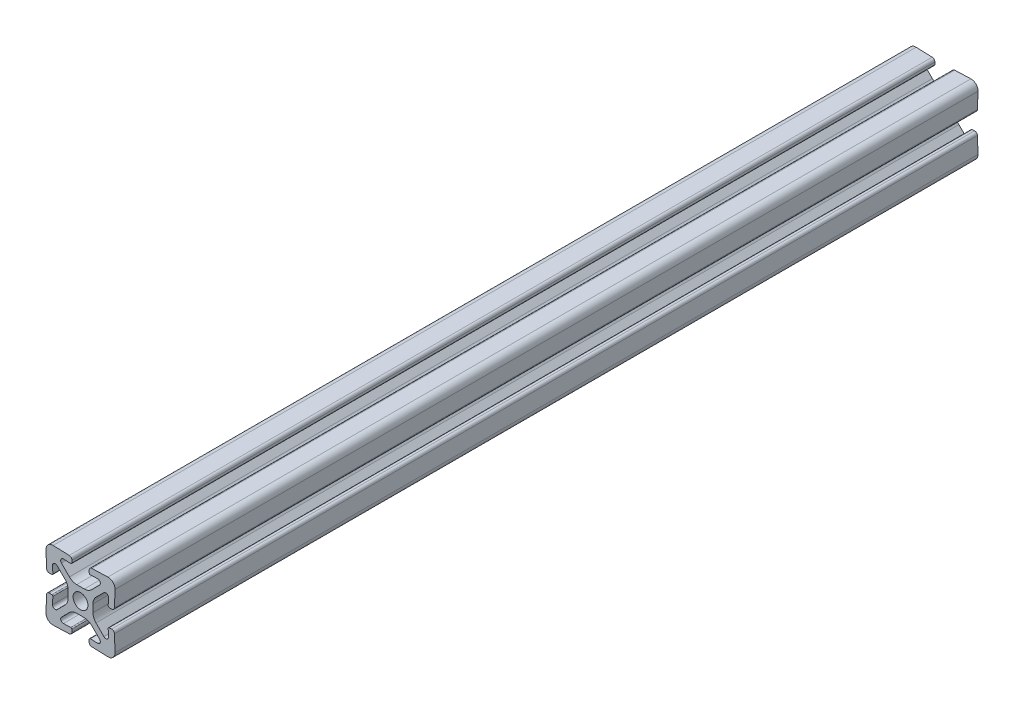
ISO-10303-21;
HEADER;
FILE_DESCRIPTION(('STEP AP214'),'2;1');
FILE_NAME('part.step','',(''),(''),'','','');
FILE_SCHEMA(('AUTOMOTIVE_DESIGN { 1 0 10303 214 1 1 1 1 }'));
ENDSEC;
DATA;
#1=APPLICATION_CONTEXT('core data for automotive mechanical design processes');
#2=APPLICATION_PROTOCOL_DEFINITION('international standard','automotive_design',2000,#1);
#3=PRODUCT_CONTEXT('',#1,'mechanical');
#4=PRODUCT('Part','Part','',(#3));
#5=PRODUCT_RELATED_PRODUCT_CATEGORY('part','',(#4));
#6=PRODUCT_DEFINITION_FORMATION('','',#4);
#7=PRODUCT_DEFINITION_CONTEXT('part definition',#1,'design');
#8=PRODUCT_DEFINITION('design','',#6,#7);
#9=PRODUCT_DEFINITION_SHAPE('','',#8);
#10=(LENGTH_UNIT() NAMED_UNIT(*) SI_UNIT(.MILLI.,.METRE.));
#11=(NAMED_UNIT(*) PLANE_ANGLE_UNIT() SI_UNIT($,.RADIAN.));
#12=(NAMED_UNIT(*) SI_UNIT($,.STERADIAN.) SOLID_ANGLE_UNIT());
#13=UNCERTAINTY_MEASURE_WITH_UNIT(LENGTH_MEASURE(1.E-05),#10,'distance_accuracy_value','');
#14=(GEOMETRIC_REPRESENTATION_CONTEXT(3) GLOBAL_UNCERTAINTY_ASSIGNED_CONTEXT((#13)) GLOBAL_UNIT_ASSIGNED_CONTEXT((#10,
#11,#12)) REPRESENTATION_CONTEXT('',''));
#15=CARTESIAN_POINT('',(0.,0.,0.));
#16=DIRECTION('',(0.,0.,1.));
#17=DIRECTION('',(1.,0.,0.));
#18=AXIS2_PLACEMENT_3D('',#15,#16,#17);
#19=CARTESIAN_POINT('',(-2.82473423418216,8.31958050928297,125.));
#20=DIRECTION('',(0.,0.,-1.));
#21=DIRECTION('',(-1.,0.,0.));
#22=AXIS2_PLACEMENT_3D('',#19,#20,#21);
#23=CYLINDRICAL_SURFACE('',#22,0.3);
#24=CARTESIAN_POINT('',(-2.82473423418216,8.31958050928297,-125.));
#25=DIRECTION('',(0.,0.,1.));
#26=DIRECTION('',(1.,0.,0.));
#27=AXIS2_PLACEMENT_3D('',#24,#25,#26);
#28=CIRCLE('',#27,0.3);
#29=CARTESIAN_POINT('',(-2.8352040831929,8.01976326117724,-125.));
#30=VERTEX_POINT('',#29);
#31=CARTESIAN_POINT('',(-2.52491698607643,8.30911066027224,-125.));
#32=VERTEX_POINT('',#31);
#33=EDGE_CURVE('E214',#30,#32,#28,.T.);
#34=ORIENTED_EDGE('',*,*,#33,.T.);
#35=DIRECTION('',(0.,0.,-1.));
#36=VECTOR('',#35,1.);
#37=CARTESIAN_POINT('',(-2.52491698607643,8.30911066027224,125.));
#38=LINE('',#37,#36);
#39=CARTESIAN_POINT('',(-2.52491698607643,8.30911066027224,125.));
#40=VERTEX_POINT('',#39);
#41=EDGE_CURVE('E11',#40,#32,#38,.T.);
#42=ORIENTED_EDGE('',*,*,#41,.F.);
#43=CARTESIAN_POINT('',(-2.82473423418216,8.31958050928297,125.));
#44=DIRECTION('',(0.,0.,1.));
#45=DIRECTION('',(1.,0.,0.));
#46=AXIS2_PLACEMENT_3D('',#43,#44,#45);
#47=CIRCLE('',#46,0.3);
#48=CARTESIAN_POINT('',(-2.8352040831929,8.01976326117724,125.));
#49=VERTEX_POINT('',#48);
#50=EDGE_CURVE('E275',#49,#40,#47,.T.);
#51=ORIENTED_EDGE('',*,*,#50,.F.);
#52=DIRECTION('',(0.,0.,-1.));
#53=VECTOR('',#52,1.);
#54=CARTESIAN_POINT('',(-2.8352040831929,8.01976326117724,125.));
#55=LINE('',#54,#53);
#56=EDGE_CURVE('E210',#49,#30,#55,.T.);
#57=ORIENTED_EDGE('',*,*,#56,.T.);
#58=EDGE_LOOP('',(#34,#42,#51,#57));
#59=FACE_BOUND('',#58,.T.);
#60=ADVANCED_FACE('F47',(#59),#23,.T.);
#61=CARTESIAN_POINT('',(-2.52491698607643,8.30911066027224,125.));
#62=DIRECTION('',(-0.999390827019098,0.0348994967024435,0.));
#63=DIRECTION('',(-0.0348994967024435,-0.999390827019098,0.));
#64=AXIS2_PLACEMENT_3D('',#61,#62,#63);
#65=PLANE('',#64);
#66=DIRECTION('',(0.0348994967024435,0.999390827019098,0.));
#67=VECTOR('',#66,1.);
#68=CARTESIAN_POINT('',(-2.52491698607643,8.30911066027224,-125.));
#69=LINE('',#68,#67);
#70=CARTESIAN_POINT('',(-2.50048733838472,9.00868423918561,-125.));
#71=VERTEX_POINT('',#70);
#72=EDGE_CURVE('E218',#32,#71,#69,.T.);
#73=ORIENTED_EDGE('',*,*,#72,.T.);
#74=DIRECTION('',(0.,0.,-1.));
#75=VECTOR('',#74,1.);
#76=CARTESIAN_POINT('',(-2.50048733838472,9.00868423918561,125.));
#77=LINE('',#76,#75);
#78=CARTESIAN_POINT('',(-2.50048733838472,9.00868423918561,125.));
#79=VERTEX_POINT('',#78);
#80=EDGE_CURVE('E56',#79,#71,#77,.T.);
#81=ORIENTED_EDGE('',*,*,#80,.F.);
#82=DIRECTION('',(0.0348994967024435,0.999390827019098,0.));
#83=VECTOR('',#82,1.);
#84=CARTESIAN_POINT('',(-2.52491698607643,8.30911066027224,125.));
#85=LINE('',#84,#83);
#86=EDGE_CURVE('E138',#40,#79,#85,.T.);
#87=ORIENTED_EDGE('',*,*,#86,.F.);
#88=ORIENTED_EDGE('',*,*,#41,.T.);
#89=EDGE_LOOP('',(#73,#81,#87,#88));
#90=FACE_BOUND('',#89,.T.);
#91=ADVANCED_FACE('F425',(#90),#65,.F.);
#92=CARTESIAN_POINT('',(-3.3,9.03660383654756,125.));
#93=DIRECTION('',(0.,0.,-1.));
#94=DIRECTION('',(-1.,0.,0.));
#95=AXIS2_PLACEMENT_3D('',#92,#93,#94);
#96=CYLINDRICAL_SURFACE('',#95,0.799999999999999);
#97=CARTESIAN_POINT('',(-3.3,9.03660383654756,-125.));
#98=DIRECTION('',(0.,0.,1.));
#99=DIRECTION('',(1.,0.,0.));
#100=AXIS2_PLACEMENT_3D('',#97,#98,#99);
#101=CIRCLE('',#100,0.799999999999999);
#102=CARTESIAN_POINT('',(-3.27208040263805,9.83611649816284,-125.));
#103=VERTEX_POINT('',#102);
#104=EDGE_CURVE('E222',#71,#103,#101,.T.);
#105=ORIENTED_EDGE('',*,*,#104,.T.);
#106=DIRECTION('',(0.,0.,-1.));
#107=VECTOR('',#106,1.);
#108=CARTESIAN_POINT('',(-3.27208040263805,9.83611649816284,125.));
#109=LINE('',#108,#107);
#110=CARTESIAN_POINT('',(-3.27208040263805,9.83611649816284,125.));
#111=VERTEX_POINT('',#110);
#112=EDGE_CURVE('E326',#111,#103,#109,.T.);
#113=ORIENTED_EDGE('',*,*,#112,.F.);
#114=CARTESIAN_POINT('',(-3.3,9.03660383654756,125.));
#115=DIRECTION('',(0.,0.,1.));
#116=DIRECTION('',(1.,0.,0.));
#117=AXIS2_PLACEMENT_3D('',#114,#115,#116);
#118=CIRCLE('',#117,0.799999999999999);
#119=EDGE_CURVE('E336',#79,#111,#118,.T.);
#120=ORIENTED_EDGE('',*,*,#119,.F.);
#121=ORIENTED_EDGE('',*,*,#80,.T.);
#122=EDGE_LOOP('',(#105,#113,#120,#121));
#123=FACE_BOUND('',#122,.T.);
#124=ADVANCED_FACE('F334',(#123),#96,.T.);
#125=CARTESIAN_POINT('',(-7.9302010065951,9.99878165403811,125.));
#126=DIRECTION('',(-0.0348994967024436,-0.999390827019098,0.));
#127=DIRECTION('',(0.999390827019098,-0.0348994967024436,0.));
#128=AXIS2_PLACEMENT_3D('',#125,#126,#127);
#129=PLANE('',#128);
#130=DIRECTION('',(-0.999390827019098,0.0348994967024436,0.));
#131=VECTOR('',#130,1.);
#132=CARTESIAN_POINT('',(-7.9302010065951,9.99878165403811,-125.));
#133=LINE('',#132,#131);
#134=CARTESIAN_POINT('',(-7.9302010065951,9.99878165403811,-125.));
#135=VERTEX_POINT('',#134);
#136=EDGE_CURVE('E225',#103,#135,#133,.T.);
#137=ORIENTED_EDGE('',*,*,#136,.T.);
#138=DIRECTION('',(0.,0.,-1.));
#139=VECTOR('',#138,1.);
#140=CARTESIAN_POINT('',(-7.9302010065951,9.99878165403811,125.));
#141=LINE('',#140,#139);
#142=CARTESIAN_POINT('',(-7.9302010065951,9.99878165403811,125.));
#143=VERTEX_POINT('',#142);
#144=EDGE_CURVE('E322',#143,#135,#141,.T.);
#145=ORIENTED_EDGE('',*,*,#144,.F.);
#146=DIRECTION('',(-0.999390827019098,0.0348994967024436,0.));
#147=VECTOR('',#146,1.);
#148=CARTESIAN_POINT('',(-7.9302010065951,9.99878165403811,125.));
#149=LINE('',#148,#147);
#150=EDGE_CURVE('E357',#111,#143,#149,.T.);
#151=ORIENTED_EDGE('',*,*,#150,.F.);
#152=ORIENTED_EDGE('',*,*,#112,.T.);
#153=EDGE_LOOP('',(#137,#145,#151,#152));
#154=FACE_BOUND('',#153,.T.);
#155=ADVANCED_FACE('F347',(#154),#129,.F.);
#156=CARTESIAN_POINT('',(-7.99999999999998,7.99999999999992,125.));
#157=DIRECTION('',(0.,0.,-1.));
#158=DIRECTION('',(-1.,0.,0.));
#159=AXIS2_PLACEMENT_3D('',#156,#157,#158);
#160=CYLINDRICAL_SURFACE('',#159,2.);
#161=CARTESIAN_POINT('',(-7.99999999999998,7.99999999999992,-125.));
#162=DIRECTION('',(0.,0.,1.));
#163=DIRECTION('',(1.,0.,0.));
#164=AXIS2_PLACEMENT_3D('',#161,#162,#163);
#165=CIRCLE('',#164,2.);
#166=CARTESIAN_POINT('',(-9.99878165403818,7.93020100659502,-125.));
#167=VERTEX_POINT('',#166);
#168=EDGE_CURVE('E228',#135,#167,#165,.T.);
#169=ORIENTED_EDGE('',*,*,#168,.T.);
#170=DIRECTION('',(0.,0.,-1.));
#171=VECTOR('',#170,1.);
#172=CARTESIAN_POINT('',(-9.99878165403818,7.93020100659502,125.));
#173=LINE('',#172,#171);
#174=CARTESIAN_POINT('',(-9.99878165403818,7.93020100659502,125.));
#175=VERTEX_POINT('',#174);
#176=EDGE_CURVE('E318',#175,#167,#173,.T.);
#177=ORIENTED_EDGE('',*,*,#176,.F.);
#178=CARTESIAN_POINT('',(-7.99999999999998,7.99999999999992,125.));
#179=DIRECTION('',(0.,0.,1.));
#180=DIRECTION('',(1.,0.,0.));
#181=AXIS2_PLACEMENT_3D('',#178,#179,#180);
#182=CIRCLE('',#181,2.);
#183=EDGE_CURVE('E353',#143,#175,#182,.T.);
#184=ORIENTED_EDGE('',*,*,#183,.F.);
#185=ORIENTED_EDGE('',*,*,#144,.T.);
#186=EDGE_LOOP('',(#169,#177,#184,#185));
#187=FACE_BOUND('',#186,.T.);
#188=ADVANCED_FACE('F351',(#187),#160,.T.);
#189=CARTESIAN_POINT('',(-9.99878165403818,7.93020100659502,125.));
#190=DIRECTION('',(0.999390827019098,0.0348994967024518,0.));
#191=DIRECTION('',(-0.0348994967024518,0.999390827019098,0.));
#192=AXIS2_PLACEMENT_3D('',#189,#190,#191);
#193=PLANE('',#192);
#194=DIRECTION('',(0.0348994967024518,-0.999390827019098,0.));
#195=VECTOR('',#194,1.);
#196=CARTESIAN_POINT('',(-9.99878165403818,7.93020100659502,-125.));
#197=LINE('',#196,#195);
#198=CARTESIAN_POINT('',(-9.83611649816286,3.27208040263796,-125.));
#199=VERTEX_POINT('',#198);
#200=EDGE_CURVE('E231',#167,#199,#197,.T.);
#201=ORIENTED_EDGE('',*,*,#200,.T.);
#202=DIRECTION('',(0.,0.,-1.));
#203=VECTOR('',#202,1.);
#204=CARTESIAN_POINT('',(-9.83611649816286,3.27208040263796,125.));
#205=LINE('',#204,#203);
#206=CARTESIAN_POINT('',(-9.83611649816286,3.27208040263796,125.));
#207=VERTEX_POINT('',#206);
#208=EDGE_CURVE('E314',#207,#199,#205,.T.);
#209=ORIENTED_EDGE('',*,*,#208,.F.);
#210=DIRECTION('',(0.0348994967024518,-0.999390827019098,0.));
#211=VECTOR('',#210,1.);
#212=CARTESIAN_POINT('',(-9.99878165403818,7.93020100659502,125.));
#213=LINE('',#212,#211);
#214=EDGE_CURVE('E356',#175,#207,#213,.T.);
#215=ORIENTED_EDGE('',*,*,#214,.F.);
#216=ORIENTED_EDGE('',*,*,#176,.T.);
#217=EDGE_LOOP('',(#201,#209,#215,#216));
#218=FACE_BOUND('',#217,.T.);
#219=ADVANCED_FACE('F438',(#218),#193,.F.);
#220=CARTESIAN_POINT('',(-9.03660383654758,3.29999999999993,125.));
#221=DIRECTION('',(0.,0.,-1.));
#222=DIRECTION('',(-1.,0.,0.));
#223=AXIS2_PLACEMENT_3D('',#220,#221,#222);
#224=CYLINDRICAL_SURFACE('',#223,0.800000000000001);
#225=CARTESIAN_POINT('',(-9.03660383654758,3.29999999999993,-125.));
#226=DIRECTION('',(0.,0.,1.));
#227=DIRECTION('',(-1.,0.,0.));
#228=AXIS2_PLACEMENT_3D('',#225,#226,#227);
#229=CIRCLE('',#228,0.800000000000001);
#230=CARTESIAN_POINT('',(-9.00868423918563,2.50048733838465,-125.));
#231=VERTEX_POINT('',#230);
#232=EDGE_CURVE('E234',#199,#231,#229,.T.);
#233=ORIENTED_EDGE('',*,*,#232,.T.);
#234=DIRECTION('',(0.,0.,-1.));
#235=VECTOR('',#234,1.);
#236=CARTESIAN_POINT('',(-9.00868423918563,2.50048733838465,125.));
#237=LINE('',#236,#235);
#238=CARTESIAN_POINT('',(-9.00868423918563,2.50048733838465,125.));
#239=VERTEX_POINT('',#238);
#240=EDGE_CURVE('E310',#239,#231,#237,.T.);
#241=ORIENTED_EDGE('',*,*,#240,.F.);
#242=CARTESIAN_POINT('',(-9.03660383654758,3.29999999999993,125.));
#243=DIRECTION('',(0.,0.,1.));
#244=DIRECTION('',(-1.,0.,0.));
#245=AXIS2_PLACEMENT_3D('',#242,#243,#244);
#246=CIRCLE('',#245,0.800000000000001);
#247=EDGE_CURVE('E361',#207,#239,#246,.T.);
#248=ORIENTED_EDGE('',*,*,#247,.F.);
#249=ORIENTED_EDGE('',*,*,#208,.T.);
#250=EDGE_LOOP('',(#233,#241,#248,#249));
#251=FACE_BOUND('',#250,.T.);
#252=ADVANCED_FACE('F441',(#251),#224,.T.);
#253=CARTESIAN_POINT('',(-8.30911066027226,2.52491698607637,125.));
#254=DIRECTION('',(-0.0348994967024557,0.999390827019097,0.));
#255=DIRECTION('',(-0.999390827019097,-0.0348994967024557,0.));
#256=AXIS2_PLACEMENT_3D('',#253,#254,#255);
#257=PLANE('',#256);
#258=DIRECTION('',(0.999390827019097,0.0348994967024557,0.));
#259=VECTOR('',#258,1.);
#260=CARTESIAN_POINT('',(-8.30911066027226,2.52491698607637,-125.));
#261=LINE('',#260,#259);
#262=CARTESIAN_POINT('',(-8.30911066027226,2.52491698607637,-125.));
#263=VERTEX_POINT('',#262);
#264=EDGE_CURVE('E237',#231,#263,#261,.T.);
#265=ORIENTED_EDGE('',*,*,#264,.T.);
#266=DIRECTION('',(0.,0.,-1.));
#267=VECTOR('',#266,1.);
#268=CARTESIAN_POINT('',(-8.30911066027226,2.52491698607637,125.));
#269=LINE('',#268,#267);
#270=CARTESIAN_POINT('',(-8.30911066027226,2.52491698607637,125.));
#271=VERTEX_POINT('',#270);
#272=EDGE_CURVE('E306',#271,#263,#269,.T.);
#273=ORIENTED_EDGE('',*,*,#272,.F.);
#274=DIRECTION('',(0.999390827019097,0.0348994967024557,0.));
#275=VECTOR('',#274,1.);
#276=CARTESIAN_POINT('',(-8.30911066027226,2.52491698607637,125.));
#277=LINE('',#276,#275);
#278=EDGE_CURVE('E368',#239,#271,#277,.T.);
#279=ORIENTED_EDGE('',*,*,#278,.F.);
#280=ORIENTED_EDGE('',*,*,#240,.T.);
#281=EDGE_LOOP('',(#265,#273,#279,#280));
#282=FACE_BOUND('',#281,.T.);
#283=ADVANCED_FACE('F445',(#282),#257,.F.);
#284=CARTESIAN_POINT('',(-8.31958050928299,2.82473423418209,125.));
#285=DIRECTION('',(0.,0.,-1.));
#286=DIRECTION('',(-1.,0.,0.));
#287=AXIS2_PLACEMENT_3D('',#284,#285,#286);
#288=CYLINDRICAL_SURFACE('',#287,0.299999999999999);
#289=CARTESIAN_POINT('',(-8.31958050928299,2.82473423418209,-125.));
#290=DIRECTION('',(0.,0.,1.));
#291=DIRECTION('',(-1.,0.,0.));
#292=AXIS2_PLACEMENT_3D('',#289,#290,#291);
#293=CIRCLE('',#292,0.299999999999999);
#294=CARTESIAN_POINT('',(-8.01976326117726,2.83520408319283,-125.));
#295=VERTEX_POINT('',#294);
#296=EDGE_CURVE('E240',#263,#295,#293,.T.);
#297=ORIENTED_EDGE('',*,*,#296,.T.);
#298=DIRECTION('',(0.,0.,-1.));
#299=VECTOR('',#298,1.);
#300=CARTESIAN_POINT('',(-8.01976326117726,2.83520408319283,125.));
#301=LINE('',#300,#299);
#302=CARTESIAN_POINT('',(-8.01976326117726,2.83520408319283,125.));
#303=VERTEX_POINT('',#302);
#304=EDGE_CURVE('E302',#303,#295,#301,.T.);
#305=ORIENTED_EDGE('',*,*,#304,.F.);
#306=CARTESIAN_POINT('',(-8.31958050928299,2.82473423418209,125.));
#307=DIRECTION('',(0.,0.,1.));
#308=DIRECTION('',(-1.,0.,0.));
#309=AXIS2_PLACEMENT_3D('',#306,#307,#308);
#310=CIRCLE('',#309,0.299999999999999);
#311=EDGE_CURVE('E371',#271,#303,#310,.T.);
#312=ORIENTED_EDGE('',*,*,#311,.F.);
#313=ORIENTED_EDGE('',*,*,#272,.T.);
#314=EDGE_LOOP('',(#297,#305,#312,#313));
#315=FACE_BOUND('',#314,.T.);
#316=ADVANCED_FACE('F449',(#315),#288,.T.);
#317=CARTESIAN_POINT('',(-8.01976326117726,2.83520408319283,125.));
#318=DIRECTION('',(-0.999390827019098,-0.0348994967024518,0.));
#319=DIRECTION('',(0.0348994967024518,-0.999390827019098,0.));
#320=AXIS2_PLACEMENT_3D('',#317,#318,#319);
#321=PLANE('',#320);
#322=DIRECTION('',(-0.0348994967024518,0.999390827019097,0.));
#323=VECTOR('',#322,1.);
#324=CARTESIAN_POINT('',(-8.01976326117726,2.83520408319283,-125.));
#325=LINE('',#324,#323);
#326=CARTESIAN_POINT('',(-8.09371946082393,4.95303254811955,-125.));
#327=VERTEX_POINT('',#326);
#328=EDGE_CURVE('E243',#295,#327,#325,.T.);
#329=ORIENTED_EDGE('',*,*,#328,.T.);
#330=DIRECTION('',(0.,0.,-1.));
#331=VECTOR('',#330,1.);
#332=CARTESIAN_POINT('',(-8.09371946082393,4.95303254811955,125.));
#333=LINE('',#332,#331);
#334=CARTESIAN_POINT('',(-8.09371946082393,4.95303254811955,125.));
#335=VERTEX_POINT('',#334);
#336=EDGE_CURVE('E298',#335,#327,#333,.T.);
#337=ORIENTED_EDGE('',*,*,#336,.F.);
#338=DIRECTION('',(-0.0348994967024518,0.999390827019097,0.));
#339=VECTOR('',#338,1.);
#340=CARTESIAN_POINT('',(-8.01976326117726,2.83520408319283,125.));
#341=LINE('',#340,#339);
#342=EDGE_CURVE('E374',#303,#335,#341,.T.);
#343=ORIENTED_EDGE('',*,*,#342,.F.);
#344=ORIENTED_EDGE('',*,*,#304,.T.);
#345=EDGE_LOOP('',(#329,#337,#343,#344));
#346=FACE_BOUND('',#345,.T.);
#347=ADVANCED_FACE('F453',(#346),#321,.F.);
#348=CARTESIAN_POINT('',(-7.3240969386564,4.97990835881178,125.));
#349=DIRECTION('',(0.,0.,-1.));
#350=DIRECTION('',(-1.,0.,0.));
#351=AXIS2_PLACEMENT_3D('',#348,#349,#350);
#352=CYLINDRICAL_SURFACE('',#351,0.770091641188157);
#353=CARTESIAN_POINT('',(-7.3240969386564,4.97990835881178,-125.));
#354=DIRECTION('',(0.,0.,-1.));
#355=DIRECTION('',(-1.,0.,0.));
#356=AXIS2_PLACEMENT_3D('',#353,#354,#355);
#357=CIRCLE('',#356,0.770091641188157);
#358=CARTESIAN_POINT('',(-6.77955991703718,5.52444538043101,-125.));
#359=VERTEX_POINT('',#358);
#360=EDGE_CURVE('E246',#327,#359,#357,.T.);
#361=ORIENTED_EDGE('',*,*,#360,.T.);
#362=DIRECTION('',(0.,0.,-1.));
#363=VECTOR('',#362,1.);
#364=CARTESIAN_POINT('',(-6.77955991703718,5.52444538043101,125.));
#365=LINE('',#364,#363);
#366=CARTESIAN_POINT('',(-6.77955991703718,5.52444538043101,125.));
#367=VERTEX_POINT('',#366);
#368=EDGE_CURVE('E294',#367,#359,#365,.T.);
#369=ORIENTED_EDGE('',*,*,#368,.F.);
#370=CARTESIAN_POINT('',(-7.3240969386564,4.97990835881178,125.));
#371=DIRECTION('',(0.,0.,-1.));
#372=DIRECTION('',(-1.,0.,0.));
#373=AXIS2_PLACEMENT_3D('',#370,#371,#372);
#374=CIRCLE('',#373,0.770091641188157);
#375=EDGE_CURVE('E377',#335,#367,#374,.T.);
#376=ORIENTED_EDGE('',*,*,#375,.F.);
#377=ORIENTED_EDGE('',*,*,#336,.T.);
#378=EDGE_LOOP('',(#361,#369,#376,#377));
#379=FACE_BOUND('',#378,.T.);
#380=ADVANCED_FACE('F457',(#379),#352,.F.);
#381=CARTESIAN_POINT('',(-4.47867965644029,3.22356511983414,125.));
#382=DIRECTION('',(0.707106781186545,0.70710678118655,0.));
#383=DIRECTION('',(-0.70710678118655,0.707106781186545,0.));
#384=AXIS2_PLACEMENT_3D('',#381,#382,#383);
#385=PLANE('',#384);
#386=DIRECTION('',(0.70710678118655,-0.707106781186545,0.));
#387=VECTOR('',#386,1.);
#388=CARTESIAN_POINT('',(-4.47867965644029,3.22356511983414,-125.));
#389=LINE('',#388,#387);
#390=CARTESIAN_POINT('',(-4.47867965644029,3.22356511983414,-125.));
#391=VERTEX_POINT('',#390);
#392=EDGE_CURVE('E249',#359,#391,#389,.T.);
#393=ORIENTED_EDGE('',*,*,#392,.T.);
#394=DIRECTION('',(0.,0.,-1.));
#395=VECTOR('',#394,1.);
#396=CARTESIAN_POINT('',(-4.47867965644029,3.22356511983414,125.));
#397=LINE('',#396,#395);
#398=CARTESIAN_POINT('',(-4.47867965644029,3.22356511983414,125.));
#399=VERTEX_POINT('',#398);
#400=EDGE_CURVE('E290',#399,#391,#397,.T.);
#401=ORIENTED_EDGE('',*,*,#400,.F.);
#402=DIRECTION('',(0.70710678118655,-0.707106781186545,0.));
#403=VECTOR('',#402,1.);
#404=CARTESIAN_POINT('',(-4.47867965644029,3.22356511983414,125.));
#405=LINE('',#404,#403);
#406=EDGE_CURVE('E380',#367,#399,#405,.T.);
#407=ORIENTED_EDGE('',*,*,#406,.F.);
#408=ORIENTED_EDGE('',*,*,#368,.T.);
#409=EDGE_LOOP('',(#393,#401,#407,#408));
#410=FACE_BOUND('',#409,.T.);
#411=ADVANCED_FACE('F461',(#410),#385,.F.);
#412=CARTESIAN_POINT('',(-6.59999999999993,1.10224477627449,125.));
#413=DIRECTION('',(0.,0.,-1.));
#414=DIRECTION('',(-1.,0.,0.));
#415=AXIS2_PLACEMENT_3D('',#412,#413,#414);
#416=CYLINDRICAL_SURFACE('',#415,3.);
#417=CARTESIAN_POINT('',(-6.59999999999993,1.10224477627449,-125.));
#418=DIRECTION('',(0.,0.,-1.));
#419=DIRECTION('',(-1.,0.,0.));
#420=AXIS2_PLACEMENT_3D('',#417,#418,#419);
#421=CIRCLE('',#420,3.);
#422=CARTESIAN_POINT('',(-3.59999999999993,1.10224477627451,-125.));
#423=VERTEX_POINT('',#422);
#424=EDGE_CURVE('E252',#391,#423,#421,.T.);
#425=ORIENTED_EDGE('',*,*,#424,.T.);
#426=DIRECTION('',(0.,0.,-1.));
#427=VECTOR('',#426,1.);
#428=CARTESIAN_POINT('',(-3.59999999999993,1.10224477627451,125.));
#429=LINE('',#428,#427);
#430=CARTESIAN_POINT('',(-3.59999999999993,1.10224477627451,125.));
#431=VERTEX_POINT('',#430);
#432=EDGE_CURVE('E286',#431,#423,#429,.T.);
#433=ORIENTED_EDGE('',*,*,#432,.F.);
#434=CARTESIAN_POINT('',(-6.59999999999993,1.10224477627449,125.));
#435=DIRECTION('',(0.,0.,-1.));
#436=DIRECTION('',(-1.,0.,0.));
#437=AXIS2_PLACEMENT_3D('',#434,#435,#436);
#438=CIRCLE('',#437,3.);
#439=EDGE_CURVE('E383',#399,#431,#438,.T.);
#440=ORIENTED_EDGE('',*,*,#439,.F.);
#441=ORIENTED_EDGE('',*,*,#400,.T.);
#442=EDGE_LOOP('',(#425,#433,#440,#441));
#443=FACE_BOUND('',#442,.T.);
#444=ADVANCED_FACE('F465',(#443),#416,.F.);
#445=CARTESIAN_POINT('',(-3.59999999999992,0.,125.));
#446=DIRECTION('',(1.,0.,0.));
#447=DIRECTION('',(0.,1.,0.));
#448=AXIS2_PLACEMENT_3D('',#445,#446,#447);
#449=PLANE('',#448);
#450=DIRECTION('',(0.,-1.,0.));
#451=VECTOR('',#450,1.);
#452=CARTESIAN_POINT('',(-3.59999999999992,0.,-125.));
#453=LINE('',#452,#451);
#454=CARTESIAN_POINT('',(-3.59999999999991,-1.10224477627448,-125.));
#455=VERTEX_POINT('',#454);
#456=EDGE_CURVE('E255',#423,#455,#453,.T.);
#457=ORIENTED_EDGE('',*,*,#456,.T.);
#458=DIRECTION('',(0.,0.,-1.));
#459=VECTOR('',#458,1.);
#460=CARTESIAN_POINT('',(-3.59999999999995,-1.10224477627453,125.));
#461=LINE('',#460,#459);
#462=CARTESIAN_POINT('',(-3.59999999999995,-1.10224477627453,125.));
#463=VERTEX_POINT('',#462);
#464=EDGE_CURVE('E1200',#463,#455,#461,.T.);
#465=ORIENTED_EDGE('',*,*,#464,.F.);
#466=DIRECTION('',(0.,-1.,0.));
#467=VECTOR('',#466,1.);
#468=CARTESIAN_POINT('',(-3.59999999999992,0.,125.));
#469=LINE('',#468,#467);
#470=EDGE_CURVE('E386',#431,#463,#469,.T.);
#471=ORIENTED_EDGE('',*,*,#470,.F.);
#472=ORIENTED_EDGE('',*,*,#432,.T.);
#473=EDGE_LOOP('',(#457,#465,#471,#472));
#474=FACE_BOUND('',#473,.T.);
#475=ADVANCED_FACE('F469',(#474),#449,.F.);
#476=CARTESIAN_POINT('',(0.,0.,125.));
#477=DIRECTION('',(0.,0.,-1.));
#478=DIRECTION('',(-1.,0.,0.));
#479=AXIS2_PLACEMENT_3D('',#476,#477,#478);
#480=CYLINDRICAL_SURFACE('',#479,2.15);
#481=CARTESIAN_POINT('',(0.,0.,-125.));
#482=DIRECTION('',(0.,0.,-1.));
#483=DIRECTION('',(1.,0.,0.));
#484=AXIS2_PLACEMENT_3D('',#481,#482,#483);
#485=CIRCLE('',#484,2.15);
#486=CARTESIAN_POINT('',(2.15,0.,-125.));
#487=VERTEX_POINT('',#486);
#488=EDGE_CURVE('E259',#487,#487,#485,.T.);
#489=ORIENTED_EDGE('',*,*,#488,.T.);
#490=EDGE_LOOP('',(#489));
#491=FACE_BOUND('',#490,.T.);
#492=CARTESIAN_POINT('',(0.,0.,125.));
#493=DIRECTION('',(0.,0.,-1.));
#494=DIRECTION('',(1.,0.,0.));
#495=AXIS2_PLACEMENT_3D('',#492,#493,#494);
#496=CIRCLE('',#495,2.15);
#497=CARTESIAN_POINT('',(2.15,0.,125.));
#498=VERTEX_POINT('',#497);
#499=EDGE_CURVE('E390',#498,#498,#496,.T.);
#500=ORIENTED_EDGE('',*,*,#499,.F.);
#501=EDGE_LOOP('',(#500));
#502=FACE_BOUND('',#501,.T.);
#503=ADVANCED_FACE('F472',(#491,#502),#480,.F.);
#504=CARTESIAN_POINT('',(0.,3.59999999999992,125.));
#505=DIRECTION('',(0.,-1.,0.));
#506=DIRECTION('',(1.,0.,0.));
#507=AXIS2_PLACEMENT_3D('',#504,#505,#506);
#508=PLANE('',#507);
#509=DIRECTION('',(-1.,0.,0.));
#510=VECTOR('',#509,1.);
#511=CARTESIAN_POINT('',(0.,3.59999999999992,-125.));
#512=LINE('',#511,#510);
#513=CARTESIAN_POINT('',(1.1022447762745,3.59999999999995,-125.));
#514=VERTEX_POINT('',#513);
#515=CARTESIAN_POINT('',(-1.10224477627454,3.59999999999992,-125.));
#516=VERTEX_POINT('',#515);
#517=EDGE_CURVE('E263',#514,#516,#512,.T.);
#518=ORIENTED_EDGE('',*,*,#517,.T.);
#519=DIRECTION('',(0.,0.,-1.));
#520=VECTOR('',#519,1.);
#521=CARTESIAN_POINT('',(-1.10224477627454,3.59999999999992,125.));
#522=LINE('',#521,#520);
#523=CARTESIAN_POINT('',(-1.10224477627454,3.59999999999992,125.));
#524=VERTEX_POINT('',#523);
#525=EDGE_CURVE('E282',#524,#516,#522,.T.);
#526=ORIENTED_EDGE('',*,*,#525,.F.);
#527=DIRECTION('',(-1.,0.,0.));
#528=VECTOR('',#527,1.);
#529=CARTESIAN_POINT('',(0.,3.59999999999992,125.));
#530=LINE('',#529,#528);
#531=CARTESIAN_POINT('',(1.10224477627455,3.5999999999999,125.));
#532=VERTEX_POINT('',#531);
#533=EDGE_CURVE('E394',#532,#524,#530,.T.);
#534=ORIENTED_EDGE('',*,*,#533,.F.);
#535=DIRECTION('',(0.,0.,-1.));
#536=VECTOR('',#535,1.);
#537=CARTESIAN_POINT('',(1.10224477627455,3.5999999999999,125.));
#538=LINE('',#537,#536);
#539=EDGE_CURVE('E1632',#532,#514,#538,.T.);
#540=ORIENTED_EDGE('',*,*,#539,.T.);
#541=EDGE_LOOP('',(#518,#526,#534,#540));
#542=FACE_BOUND('',#541,.T.);
#543=ADVANCED_FACE('F406',(#542),#508,.F.);
#544=CARTESIAN_POINT('',(-1.10224477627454,6.59999999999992,125.));
#545=DIRECTION('',(0.,0.,-1.));
#546=DIRECTION('',(-1.,0.,0.));
#547=AXIS2_PLACEMENT_3D('',#544,#545,#546);
#548=CYLINDRICAL_SURFACE('',#547,3.);
#549=CARTESIAN_POINT('',(-1.10224477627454,6.59999999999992,-125.));
#550=DIRECTION('',(0.,0.,-1.));
#551=DIRECTION('',(1.,0.,0.));
#552=AXIS2_PLACEMENT_3D('',#549,#550,#551);
#553=CIRCLE('',#552,3.);
#554=CARTESIAN_POINT('',(-3.22356511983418,4.47867965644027,-125.));
#555=VERTEX_POINT('',#554);
#556=EDGE_CURVE('E266',#516,#555,#553,.T.);
#557=ORIENTED_EDGE('',*,*,#556,.T.);
#558=DIRECTION('',(0.,0.,-1.));
#559=VECTOR('',#558,1.);
#560=CARTESIAN_POINT('',(-3.22356511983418,4.47867965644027,125.));
#561=LINE('',#560,#559);
#562=CARTESIAN_POINT('',(-3.22356511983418,4.47867965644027,125.));
#563=VERTEX_POINT('',#562);
#564=EDGE_CURVE('E203',#563,#555,#561,.T.);
#565=ORIENTED_EDGE('',*,*,#564,.F.);
#566=CARTESIAN_POINT('',(-1.10224477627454,6.59999999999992,125.));
#567=DIRECTION('',(0.,0.,-1.));
#568=DIRECTION('',(1.,0.,0.));
#569=AXIS2_PLACEMENT_3D('',#566,#567,#568);
#570=CIRCLE('',#569,3.);
#571=EDGE_CURVE('E192',#524,#563,#570,.T.);
#572=ORIENTED_EDGE('',*,*,#571,.F.);
#573=ORIENTED_EDGE('',*,*,#525,.T.);
#574=EDGE_LOOP('',(#557,#565,#572,#573));
#575=FACE_BOUND('',#574,.T.);
#576=ADVANCED_FACE('F409',(#575),#548,.F.);
#577=CARTESIAN_POINT('',(-3.22356511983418,4.47867965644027,125.));
#578=DIRECTION('',(-0.707106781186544,-0.707106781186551,0.));
#579=DIRECTION('',(0.707106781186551,-0.707106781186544,0.));
#580=AXIS2_PLACEMENT_3D('',#577,#578,#579);
#581=PLANE('',#580);
#582=DIRECTION('',(-0.707106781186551,0.707106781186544,0.));
#583=VECTOR('',#582,1.);
#584=CARTESIAN_POINT('',(-3.22356511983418,4.47867965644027,-125.));
#585=LINE('',#584,#583);
#586=CARTESIAN_POINT('',(-5.52444538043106,6.77955991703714,-125.));
#587=VERTEX_POINT('',#586);
#588=EDGE_CURVE('E201',#555,#587,#585,.T.);
#589=ORIENTED_EDGE('',*,*,#588,.T.);
#590=DIRECTION('',(0.,0.,-1.));
#591=VECTOR('',#590,1.);
#592=CARTESIAN_POINT('',(-5.52444538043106,6.77955991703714,125.));
#593=LINE('',#592,#591);
#594=CARTESIAN_POINT('',(-5.52444538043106,6.77955991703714,125.));
#595=VERTEX_POINT('',#594);
#596=EDGE_CURVE('E198',#595,#587,#593,.T.);
#597=ORIENTED_EDGE('',*,*,#596,.F.);
#598=DIRECTION('',(-0.707106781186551,0.707106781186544,0.));
#599=VECTOR('',#598,1.);
#600=CARTESIAN_POINT('',(-3.22356511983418,4.47867965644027,125.));
#601=LINE('',#600,#599);
#602=EDGE_CURVE('E184',#563,#595,#601,.T.);
#603=ORIENTED_EDGE('',*,*,#602,.F.);
#604=ORIENTED_EDGE('',*,*,#564,.T.);
#605=EDGE_LOOP('',(#589,#597,#603,#604));
#606=FACE_BOUND('',#605,.T.);
#607=ADVANCED_FACE('F199',(#606),#581,.F.);
#608=CARTESIAN_POINT('',(-4.97990835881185,7.32409693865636,125.));
#609=DIRECTION('',(0.,0.,-1.));
#610=DIRECTION('',(-1.,0.,0.));
#611=AXIS2_PLACEMENT_3D('',#608,#609,#610);
#612=CYLINDRICAL_SURFACE('',#611,0.770091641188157);
#613=CARTESIAN_POINT('',(-4.97990835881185,7.32409693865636,-125.));
#614=DIRECTION('',(0.,0.,-1.));
#615=DIRECTION('',(1.,0.,0.));
#616=AXIS2_PLACEMENT_3D('',#613,#614,#615);
#617=CIRCLE('',#616,0.770091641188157);
#618=CARTESIAN_POINT('',(-4.95303254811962,8.09371946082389,-125.));
#619=VERTEX_POINT('',#618);
#620=EDGE_CURVE('E124',#587,#619,#617,.T.);
#621=ORIENTED_EDGE('',*,*,#620,.T.);
#622=DIRECTION('',(0.,0.,-1.));
#623=VECTOR('',#622,1.);
#624=CARTESIAN_POINT('',(-4.95303254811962,8.09371946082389,125.));
#625=LINE('',#624,#623);
#626=CARTESIAN_POINT('',(-4.95303254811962,8.09371946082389,125.));
#627=VERTEX_POINT('',#626);
#628=EDGE_CURVE('E204',#627,#619,#625,.T.);
#629=ORIENTED_EDGE('',*,*,#628,.F.);
#630=CARTESIAN_POINT('',(-4.97990835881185,7.32409693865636,125.));
#631=DIRECTION('',(0.,0.,-1.));
#632=DIRECTION('',(1.,0.,0.));
#633=AXIS2_PLACEMENT_3D('',#630,#631,#632);
#634=CIRCLE('',#633,0.770091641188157);
#635=EDGE_CURVE('E190',#595,#627,#634,.T.);
#636=ORIENTED_EDGE('',*,*,#635,.F.);
#637=ORIENTED_EDGE('',*,*,#596,.T.);
#638=EDGE_LOOP('',(#621,#629,#636,#637));
#639=FACE_BOUND('',#638,.T.);
#640=ADVANCED_FACE('F206',(#639),#612,.F.);
#641=CARTESIAN_POINT('',(-2.8352040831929,8.01976326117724,125.));
#642=DIRECTION('',(0.0348994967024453,0.999390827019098,0.));
#643=DIRECTION('',(-0.999390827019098,0.0348994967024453,0.));
#644=AXIS2_PLACEMENT_3D('',#641,#642,#643);
#645=PLANE('',#644);
#646=DIRECTION('',(0.999390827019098,-0.0348994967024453,0.));
#647=VECTOR('',#646,1.);
#648=CARTESIAN_POINT('',(-2.8352040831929,8.01976326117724,-125.));
#649=LINE('',#648,#647);
#650=EDGE_CURVE('E130',#619,#30,#649,.T.);
#651=ORIENTED_EDGE('',*,*,#650,.T.);
#652=ORIENTED_EDGE('',*,*,#56,.F.);
#653=DIRECTION('',(0.999390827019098,-0.0348994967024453,0.));
#654=VECTOR('',#653,1.);
#655=CARTESIAN_POINT('',(-2.8352040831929,8.01976326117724,125.));
#656=LINE('',#655,#654);
#657=EDGE_CURVE('E64',#627,#49,#656,.T.);
#658=ORIENTED_EDGE('',*,*,#657,.F.);
#659=ORIENTED_EDGE('',*,*,#628,.T.);
#660=EDGE_LOOP('',(#651,#652,#658,#659));
#661=FACE_BOUND('',#660,.T.);
#662=ADVANCED_FACE('F413',(#661),#645,.F.);
#663=CARTESIAN_POINT('',(-2.82473423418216,8.31958050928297,125.));
#664=DIRECTION('',(0.,0.,1.));
#665=DIRECTION('',(1.,0.,0.));
#666=AXIS2_PLACEMENT_3D('',#663,#664,#665);
#667=PLANE('',#666);
#668=CARTESIAN_POINT('',(1.10224477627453,6.5999999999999,125.));
#669=DIRECTION('',(0.,0.,-1.));
#670=DIRECTION('',(0.,1.,0.));
#671=AXIS2_PLACEMENT_3D('',#668,#669,#670);
#672=CIRCLE('',#671,3.);
#673=CARTESIAN_POINT('',(3.22356511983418,4.47867965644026,125.));
#674=VERTEX_POINT('',#673);
#675=EDGE_CURVE('E402',#674,#532,#672,.T.);
#676=ORIENTED_EDGE('',*,*,#675,.T.);
#677=ORIENTED_EDGE('',*,*,#533,.T.);
#678=ORIENTED_EDGE('',*,*,#571,.T.);
#679=ORIENTED_EDGE('',*,*,#602,.T.);
#680=ORIENTED_EDGE('',*,*,#635,.T.);
#681=ORIENTED_EDGE('',*,*,#657,.T.);
#682=ORIENTED_EDGE('',*,*,#50,.T.);
#683=ORIENTED_EDGE('',*,*,#86,.T.);
#684=ORIENTED_EDGE('',*,*,#119,.T.);
#685=ORIENTED_EDGE('',*,*,#150,.T.);
#686=ORIENTED_EDGE('',*,*,#183,.T.);
#687=ORIENTED_EDGE('',*,*,#214,.T.);
#688=ORIENTED_EDGE('',*,*,#247,.T.);
#689=ORIENTED_EDGE('',*,*,#278,.T.);
#690=ORIENTED_EDGE('',*,*,#311,.T.);
#691=ORIENTED_EDGE('',*,*,#342,.T.);
#692=ORIENTED_EDGE('',*,*,#375,.T.);
#693=ORIENTED_EDGE('',*,*,#406,.T.);
#694=ORIENTED_EDGE('',*,*,#439,.T.);
#695=ORIENTED_EDGE('',*,*,#470,.T.);
#696=CARTESIAN_POINT('',(-6.59999999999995,-1.1022447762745,125.));
#697=DIRECTION('',(0.,0.,-1.));
#698=DIRECTION('',(0.,1.,0.));
#699=AXIS2_PLACEMENT_3D('',#696,#697,#698);
#700=CIRCLE('',#699,3.);
#701=CARTESIAN_POINT('',(-4.47867965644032,-3.22356511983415,125.));
#702=VERTEX_POINT('',#701);
#703=EDGE_CURVE('E1695',#463,#702,#700,.T.);
#704=ORIENTED_EDGE('',*,*,#703,.T.);
#705=DIRECTION('',(-0.707106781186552,-0.707106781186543,0.));
#706=VECTOR('',#705,1.);
#707=CARTESIAN_POINT('',(-4.47867965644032,-3.22356511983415,125.));
#708=LINE('',#707,#706);
#709=CARTESIAN_POINT('',(-6.77955991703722,-5.52444538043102,125.));
#710=VERTEX_POINT('',#709);
#711=EDGE_CURVE('E1692',#702,#710,#708,.T.);
#712=ORIENTED_EDGE('',*,*,#711,.T.);
#713=CARTESIAN_POINT('',(-7.32409693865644,-4.97990835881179,125.));
#714=DIRECTION('',(0.,0.,-1.));
#715=DIRECTION('',(0.,1.,0.));
#716=AXIS2_PLACEMENT_3D('',#713,#714,#715);
#717=CIRCLE('',#716,0.770091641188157);
#718=CARTESIAN_POINT('',(-8.09371946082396,-4.95303254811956,125.));
#719=VERTEX_POINT('',#718);
#720=EDGE_CURVE('E1689',#710,#719,#717,.T.);
#721=ORIENTED_EDGE('',*,*,#720,.T.);
#722=DIRECTION('',(0.0348994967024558,0.999390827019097,0.));
#723=VECTOR('',#722,1.);
#724=CARTESIAN_POINT('',(-8.01976326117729,-2.83520408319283,125.));
#725=LINE('',#724,#723);
#726=CARTESIAN_POINT('',(-8.01976326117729,-2.83520408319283,125.));
#727=VERTEX_POINT('',#726);
#728=EDGE_CURVE('E1121',#719,#727,#725,.T.);
#729=ORIENTED_EDGE('',*,*,#728,.T.);
#730=CARTESIAN_POINT('',(-8.31958050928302,-2.8247342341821,125.));
#731=DIRECTION('',(0.,0.,1.));
#732=DIRECTION('',(0.,1.,0.));
#733=AXIS2_PLACEMENT_3D('',#730,#731,#732);
#734=CIRCLE('',#733,0.3);
#735=CARTESIAN_POINT('',(-8.30911066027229,-2.52491698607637,125.));
#736=VERTEX_POINT('',#735);
#737=EDGE_CURVE('E1112',#727,#736,#734,.T.);
#738=ORIENTED_EDGE('',*,*,#737,.T.);
#739=DIRECTION('',(-0.999390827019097,0.034899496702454,0.));
#740=VECTOR('',#739,1.);
#741=CARTESIAN_POINT('',(-8.30911066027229,-2.52491698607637,125.));
#742=LINE('',#741,#740);
#743=CARTESIAN_POINT('',(-9.00868423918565,-2.50048733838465,125.));
#744=VERTEX_POINT('',#743);
#745=EDGE_CURVE('E1743',#736,#744,#742,.T.);
#746=ORIENTED_EDGE('',*,*,#745,.T.);
#747=CARTESIAN_POINT('',(-9.03660383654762,-3.29999999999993,125.));
#748=DIRECTION('',(0.,0.,1.));
#749=DIRECTION('',(0.,1.,0.));
#750=AXIS2_PLACEMENT_3D('',#747,#748,#749);
#751=CIRCLE('',#750,0.799999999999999);
#752=CARTESIAN_POINT('',(-9.83611649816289,-3.27208040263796,125.));
#753=VERTEX_POINT('',#752);
#754=EDGE_CURVE('E1739',#744,#753,#751,.T.);
#755=ORIENTED_EDGE('',*,*,#754,.T.);
#756=DIRECTION('',(-0.0348994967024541,-0.999390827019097,0.));
#757=VECTOR('',#756,1.);
#758=CARTESIAN_POINT('',(-9.99878165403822,-7.93020100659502,125.));
#759=LINE('',#758,#757);
#760=CARTESIAN_POINT('',(-9.99878165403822,-7.93020100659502,125.));
#761=VERTEX_POINT('',#760);
#762=EDGE_CURVE('E1735',#753,#761,#759,.T.);
#763=ORIENTED_EDGE('',*,*,#762,.T.);
#764=CARTESIAN_POINT('',(-8.00000000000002,-7.99999999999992,125.));
#765=DIRECTION('',(0.,0.,1.));
#766=DIRECTION('',(0.,1.,0.));
#767=AXIS2_PLACEMENT_3D('',#764,#765,#766);
#768=CIRCLE('',#767,2.);
#769=CARTESIAN_POINT('',(-7.93020100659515,-9.99878165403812,125.));
#770=VERTEX_POINT('',#769);
#771=EDGE_CURVE('E1731',#761,#770,#768,.T.);
#772=ORIENTED_EDGE('',*,*,#771,.T.);
#773=DIRECTION('',(0.999390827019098,0.0348994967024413,0.));
#774=VECTOR('',#773,1.);
#775=CARTESIAN_POINT('',(-7.93020100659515,-9.99878165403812,125.));
#776=LINE('',#775,#774);
#777=CARTESIAN_POINT('',(-3.27208040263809,-9.83611649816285,125.));
#778=VERTEX_POINT('',#777);
#779=EDGE_CURVE('E1727',#770,#778,#776,.T.);
#780=ORIENTED_EDGE('',*,*,#779,.T.);
#781=CARTESIAN_POINT('',(-3.30000000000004,-9.03660383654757,125.));
#782=DIRECTION('',(0.,0.,1.));
#783=DIRECTION('',(0.,-1.,0.));
#784=AXIS2_PLACEMENT_3D('',#781,#782,#783);
#785=CIRCLE('',#784,0.800000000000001);
#786=CARTESIAN_POINT('',(-2.50048733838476,-9.00868423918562,125.));
#787=VERTEX_POINT('',#786);
#788=EDGE_CURVE('E1723',#778,#787,#785,.T.);
#789=ORIENTED_EDGE('',*,*,#788,.T.);
#790=DIRECTION('',(-0.0348994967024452,0.999390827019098,0.));
#791=VECTOR('',#790,1.);
#792=CARTESIAN_POINT('',(-2.52491698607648,-8.30911066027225,125.));
#793=LINE('',#792,#791);
#794=CARTESIAN_POINT('',(-2.52491698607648,-8.30911066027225,125.));
#795=VERTEX_POINT('',#794);
#796=EDGE_CURVE('E1719',#787,#795,#793,.T.);
#797=ORIENTED_EDGE('',*,*,#796,.T.);
#798=CARTESIAN_POINT('',(-2.8247342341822,-8.31958050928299,125.));
#799=DIRECTION('',(0.,0.,1.));
#800=DIRECTION('',(0.,-1.,0.));
#801=AXIS2_PLACEMENT_3D('',#798,#799,#800);
#802=CIRCLE('',#801,0.299999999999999);
#803=CARTESIAN_POINT('',(-2.83520408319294,-8.01976326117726,125.));
#804=VERTEX_POINT('',#803);
#805=EDGE_CURVE('E1715',#795,#804,#802,.T.);
#806=ORIENTED_EDGE('',*,*,#805,.T.);
#807=DIRECTION('',(-0.999390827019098,-0.0348994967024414,0.));
#808=VECTOR('',#807,1.);
#809=CARTESIAN_POINT('',(-2.83520408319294,-8.01976326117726,125.));
#810=LINE('',#809,#808);
#811=CARTESIAN_POINT('',(-4.95303254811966,-8.0937194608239,125.));
#812=VERTEX_POINT('',#811);
#813=EDGE_CURVE('E1711',#804,#812,#810,.T.);
#814=ORIENTED_EDGE('',*,*,#813,.T.);
#815=CARTESIAN_POINT('',(-4.97990835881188,-7.32409693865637,125.));
#816=DIRECTION('',(0.,0.,-1.));
#817=DIRECTION('',(0.,-1.,0.));
#818=AXIS2_PLACEMENT_3D('',#815,#816,#817);
#819=CIRCLE('',#818,0.770091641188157);
#820=CARTESIAN_POINT('',(-5.5244453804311,-6.77955991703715,125.));
#821=VERTEX_POINT('',#820);
#822=EDGE_CURVE('E1707',#812,#821,#819,.T.);
#823=ORIENTED_EDGE('',*,*,#822,.T.);
#824=DIRECTION('',(0.707106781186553,0.707106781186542,0.));
#825=VECTOR('',#824,1.);
#826=CARTESIAN_POINT('',(-3.22356511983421,-4.47867965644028,125.));
#827=LINE('',#826,#825);
#828=CARTESIAN_POINT('',(-3.22356511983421,-4.47867965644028,125.));
#829=VERTEX_POINT('',#828);
#830=EDGE_CURVE('E1703',#821,#829,#827,.T.);
#831=ORIENTED_EDGE('',*,*,#830,.T.);
#832=CARTESIAN_POINT('',(-1.10224477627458,-6.59999999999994,125.));
#833=DIRECTION('',(0.,0.,-1.));
#834=DIRECTION('',(0.,-1.,0.));
#835=AXIS2_PLACEMENT_3D('',#832,#833,#834);
#836=CIRCLE('',#835,3.);
#837=CARTESIAN_POINT('',(-1.10224477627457,-3.59999999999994,125.));
#838=VERTEX_POINT('',#837);
#839=EDGE_CURVE('E1699',#829,#838,#836,.T.);
#840=ORIENTED_EDGE('',*,*,#839,.T.);
#841=DIRECTION('',(1.,0.,0.));
#842=VECTOR('',#841,1.);
#843=CARTESIAN_POINT('',(0.,-3.59999999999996,125.));
#844=LINE('',#843,#842);
#845=CARTESIAN_POINT('',(1.10224477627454,-3.59999999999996,125.));
#846=VERTEX_POINT('',#845);
#847=EDGE_CURVE('E1309',#838,#846,#844,.T.);
#848=ORIENTED_EDGE('',*,*,#847,.T.);
#849=CARTESIAN_POINT('',(1.10224477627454,-6.59999999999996,125.));
#850=DIRECTION('',(0.,0.,-1.));
#851=DIRECTION('',(-1.,0.,0.));
#852=AXIS2_PLACEMENT_3D('',#849,#850,#851);
#853=CIRCLE('',#852,3.);
#854=CARTESIAN_POINT('',(3.22356511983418,-4.47867965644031,125.));
#855=VERTEX_POINT('',#854);
#856=EDGE_CURVE('E1313',#846,#855,#853,.T.);
#857=ORIENTED_EDGE('',*,*,#856,.T.);
#858=DIRECTION('',(0.707106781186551,-0.707106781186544,0.));
#859=VECTOR('',#858,1.);
#860=CARTESIAN_POINT('',(3.22356511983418,-4.47867965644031,125.));
#861=LINE('',#860,#859);
#862=CARTESIAN_POINT('',(5.52444538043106,-6.77955991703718,125.));
#863=VERTEX_POINT('',#862);
#864=EDGE_CURVE('E1317',#855,#863,#861,.T.);
#865=ORIENTED_EDGE('',*,*,#864,.T.);
#866=CARTESIAN_POINT('',(4.97990835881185,-7.32409693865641,125.));
#867=DIRECTION('',(0.,0.,-1.));
#868=DIRECTION('',(-1.,0.,0.));
#869=AXIS2_PLACEMENT_3D('',#866,#867,#868);
#870=CIRCLE('',#869,0.770091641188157);
#871=CARTESIAN_POINT('',(4.95303254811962,-8.09371946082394,125.));
#872=VERTEX_POINT('',#871);
#873=EDGE_CURVE('E1321',#863,#872,#870,.T.);
#874=ORIENTED_EDGE('',*,*,#873,.T.);
#875=DIRECTION('',(-0.999390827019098,0.0348994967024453,0.));
#876=VECTOR('',#875,1.);
#877=CARTESIAN_POINT('',(2.8352040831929,-8.01976326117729,125.));
#878=LINE('',#877,#876);
#879=CARTESIAN_POINT('',(2.8352040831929,-8.01976326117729,125.));
#880=VERTEX_POINT('',#879);
#881=EDGE_CURVE('E1325',#872,#880,#878,.T.);
#882=ORIENTED_EDGE('',*,*,#881,.T.);
#883=CARTESIAN_POINT('',(2.82473423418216,-8.31958050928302,125.));
#884=DIRECTION('',(0.,0.,1.));
#885=DIRECTION('',(-1.,0.,0.));
#886=AXIS2_PLACEMENT_3D('',#883,#884,#885);
#887=CIRCLE('',#886,0.3);
#888=CARTESIAN_POINT('',(2.52491698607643,-8.30911066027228,125.));
#889=VERTEX_POINT('',#888);
#890=EDGE_CURVE('E1256',#880,#889,#887,.T.);
#891=ORIENTED_EDGE('',*,*,#890,.T.);
#892=DIRECTION('',(-0.0348994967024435,-0.999390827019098,0.));
#893=VECTOR('',#892,1.);
#894=CARTESIAN_POINT('',(2.52491698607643,-8.30911066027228,125.));
#895=LINE('',#894,#893);
#896=CARTESIAN_POINT('',(2.50048733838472,-9.00868423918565,125.));
#897=VERTEX_POINT('',#896);
#898=EDGE_CURVE('E1260',#889,#897,#895,.T.);
#899=ORIENTED_EDGE('',*,*,#898,.T.);
#900=CARTESIAN_POINT('',(3.3,-9.03660383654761,125.));
#901=DIRECTION('',(0.,0.,1.));
#902=DIRECTION('',(-1.,0.,0.));
#903=AXIS2_PLACEMENT_3D('',#900,#901,#902);
#904=CIRCLE('',#903,0.799999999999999);
#905=CARTESIAN_POINT('',(3.27208040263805,-9.83611649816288,125.));
#906=VERTEX_POINT('',#905);
#907=EDGE_CURVE('E1265',#897,#906,#904,.T.);
#908=ORIENTED_EDGE('',*,*,#907,.T.);
#909=DIRECTION('',(0.999390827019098,-0.0348994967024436,0.));
#910=VECTOR('',#909,1.);
#911=CARTESIAN_POINT('',(7.9302010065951,-9.99878165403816,125.));
#912=LINE('',#911,#910);
#913=CARTESIAN_POINT('',(7.9302010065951,-9.99878165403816,125.));
#914=VERTEX_POINT('',#913);
#915=EDGE_CURVE('E1269',#906,#914,#912,.T.);
#916=ORIENTED_EDGE('',*,*,#915,.T.);
#917=CARTESIAN_POINT('',(7.99999999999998,-7.99999999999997,125.));
#918=DIRECTION('',(0.,0.,1.));
#919=DIRECTION('',(-1.,0.,0.));
#920=AXIS2_PLACEMENT_3D('',#917,#918,#919);
#921=CIRCLE('',#920,2.);
#922=CARTESIAN_POINT('',(9.99878165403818,-7.93020100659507,125.));
#923=VERTEX_POINT('',#922);
#924=EDGE_CURVE('E1273',#914,#923,#921,.T.);
#925=ORIENTED_EDGE('',*,*,#924,.T.);
#926=DIRECTION('',(-0.0348994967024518,0.999390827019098,0.));
#927=VECTOR('',#926,1.);
#928=CARTESIAN_POINT('',(9.99878165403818,-7.93020100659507,125.));
#929=LINE('',#928,#927);
#930=CARTESIAN_POINT('',(9.83611649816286,-3.27208040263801,125.));
#931=VERTEX_POINT('',#930);
#932=EDGE_CURVE('E1277',#923,#931,#929,.T.);
#933=ORIENTED_EDGE('',*,*,#932,.T.);
#934=CARTESIAN_POINT('',(9.03660383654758,-3.29999999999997,125.));
#935=DIRECTION('',(0.,0.,1.));
#936=DIRECTION('',(1.,0.,0.));
#937=AXIS2_PLACEMENT_3D('',#934,#935,#936);
#938=CIRCLE('',#937,0.800000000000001);
#939=CARTESIAN_POINT('',(9.00868423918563,-2.50048733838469,125.));
#940=VERTEX_POINT('',#939);
#941=EDGE_CURVE('E1281',#931,#940,#938,.T.);
#942=ORIENTED_EDGE('',*,*,#941,.T.);
#943=DIRECTION('',(-0.999390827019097,-0.0348994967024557,0.));
#944=VECTOR('',#943,1.);
#945=CARTESIAN_POINT('',(8.30911066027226,-2.52491698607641,125.));
#946=LINE('',#945,#944);
#947=CARTESIAN_POINT('',(8.30911066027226,-2.52491698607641,125.));
#948=VERTEX_POINT('',#947);
#949=EDGE_CURVE('E1285',#940,#948,#946,.T.);
#950=ORIENTED_EDGE('',*,*,#949,.T.);
#951=CARTESIAN_POINT('',(8.31958050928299,-2.82473423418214,125.));
#952=DIRECTION('',(0.,0.,1.));
#953=DIRECTION('',(1.,0.,0.));
#954=AXIS2_PLACEMENT_3D('',#951,#952,#953);
#955=CIRCLE('',#954,0.299999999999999);
#956=CARTESIAN_POINT('',(8.01976326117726,-2.83520408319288,125.));
#957=VERTEX_POINT('',#956);
#958=EDGE_CURVE('E1289',#948,#957,#955,.T.);
#959=ORIENTED_EDGE('',*,*,#958,.T.);
#960=DIRECTION('',(0.0348994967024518,-0.999390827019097,0.));
#961=VECTOR('',#960,1.);
#962=CARTESIAN_POINT('',(8.01976326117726,-2.83520408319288,125.));
#963=LINE('',#962,#961);
#964=CARTESIAN_POINT('',(8.09371946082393,-4.9530325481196,125.));
#965=VERTEX_POINT('',#964);
#966=EDGE_CURVE('E1293',#957,#965,#963,.T.);
#967=ORIENTED_EDGE('',*,*,#966,.T.);
#968=CARTESIAN_POINT('',(7.3240969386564,-4.97990835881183,125.));
#969=DIRECTION('',(0.,0.,-1.));
#970=DIRECTION('',(1.,0.,0.));
#971=AXIS2_PLACEMENT_3D('',#968,#969,#970);
#972=CIRCLE('',#971,0.770091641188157);
#973=CARTESIAN_POINT('',(6.77955991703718,-5.52444538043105,125.));
#974=VERTEX_POINT('',#973);
#975=EDGE_CURVE('E1297',#965,#974,#972,.T.);
#976=ORIENTED_EDGE('',*,*,#975,.T.);
#977=DIRECTION('',(-0.70710678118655,0.707106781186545,0.));
#978=VECTOR('',#977,1.);
#979=CARTESIAN_POINT('',(4.47867965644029,-3.22356511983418,125.));
#980=LINE('',#979,#978);
#981=CARTESIAN_POINT('',(4.47867965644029,-3.22356511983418,125.));
#982=VERTEX_POINT('',#981);
#983=EDGE_CURVE('E1301',#974,#982,#980,.T.);
#984=ORIENTED_EDGE('',*,*,#983,.T.);
#985=CARTESIAN_POINT('',(6.59999999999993,-1.10224477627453,125.));
#986=DIRECTION('',(0.,0.,-1.));
#987=DIRECTION('',(1.,0.,0.));
#988=AXIS2_PLACEMENT_3D('',#985,#986,#987);
#989=CIRCLE('',#988,3.);
#990=CARTESIAN_POINT('',(3.59999999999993,-1.10224477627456,125.));
#991=VERTEX_POINT('',#990);
#992=EDGE_CURVE('E1305',#982,#991,#989,.T.);
#993=ORIENTED_EDGE('',*,*,#992,.T.);
#994=DIRECTION('',(0.,1.,0.));
#995=VECTOR('',#994,1.);
#996=CARTESIAN_POINT('',(3.59999999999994,0.,125.));
#997=LINE('',#996,#995);
#998=CARTESIAN_POINT('',(3.59999999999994,1.10224477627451,125.));
#999=VERTEX_POINT('',#998);
#1000=EDGE_CURVE('E1522',#991,#999,#997,.T.);
#1001=ORIENTED_EDGE('',*,*,#1000,.T.);
#1002=CARTESIAN_POINT('',(6.59999999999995,1.1022447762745,125.));
#1003=DIRECTION('',(0.,0.,-1.));
#1004=DIRECTION('',(0.,-1.,0.));
#1005=AXIS2_PLACEMENT_3D('',#1002,#1003,#1004);
#1006=CIRCLE('',#1005,3.);
#1007=CARTESIAN_POINT('',(4.4786796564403,3.22356511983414,125.));
#1008=VERTEX_POINT('',#1007);
#1009=EDGE_CURVE('E1526',#999,#1008,#1006,.T.);
#1010=ORIENTED_EDGE('',*,*,#1009,.T.);
#1011=DIRECTION('',(0.707106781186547,0.707106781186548,0.));
#1012=VECTOR('',#1011,1.);
#1013=CARTESIAN_POINT('',(4.4786796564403,3.22356511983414,125.));
#1014=LINE('',#1013,#1012);
#1015=CARTESIAN_POINT('',(6.77955991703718,5.52444538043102,125.));
#1016=VERTEX_POINT('',#1015);
#1017=EDGE_CURVE('E1530',#1008,#1016,#1014,.T.);
#1018=ORIENTED_EDGE('',*,*,#1017,.T.);
#1019=CARTESIAN_POINT('',(7.3240969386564,4.9799083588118,125.));
#1020=DIRECTION('',(0.,0.,-1.));
#1021=DIRECTION('',(0.,-1.,0.));
#1022=AXIS2_PLACEMENT_3D('',#1019,#1020,#1021);
#1023=CIRCLE('',#1022,0.770091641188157);
#1024=CARTESIAN_POINT('',(8.09371946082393,4.95303254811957,125.));
#1025=VERTEX_POINT('',#1024);
#1026=EDGE_CURVE('E1534',#1016,#1025,#1023,.T.);
#1027=ORIENTED_EDGE('',*,*,#1026,.T.);
#1028=DIRECTION('',(-0.0348994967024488,-0.999390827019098,0.));
#1029=VECTOR('',#1028,1.);
#1030=CARTESIAN_POINT('',(8.01976326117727,2.83520408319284,125.));
#1031=LINE('',#1030,#1029);
#1032=CARTESIAN_POINT('',(8.01976326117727,2.83520408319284,125.));
#1033=VERTEX_POINT('',#1032);
#1034=EDGE_CURVE('E1538',#1025,#1033,#1031,.T.);
#1035=ORIENTED_EDGE('',*,*,#1034,.T.);
#1036=CARTESIAN_POINT('',(8.319580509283,2.82473423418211,125.));
#1037=DIRECTION('',(0.,0.,1.));
#1038=DIRECTION('',(0.,-1.,0.));
#1039=AXIS2_PLACEMENT_3D('',#1036,#1037,#1038);
#1040=CIRCLE('',#1039,0.3);
#1041=CARTESIAN_POINT('',(8.30911066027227,2.52491698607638,125.));
#1042=VERTEX_POINT('',#1041);
#1043=EDGE_CURVE('E1472',#1033,#1042,#1040,.T.);
#1044=ORIENTED_EDGE('',*,*,#1043,.T.);
#1045=DIRECTION('',(0.999390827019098,-0.034899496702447,0.));
#1046=VECTOR('',#1045,1.);
#1047=CARTESIAN_POINT('',(8.30911066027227,2.52491698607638,125.));
#1048=LINE('',#1047,#1046);
#1049=CARTESIAN_POINT('',(9.00868423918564,2.50048733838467,125.));
#1050=VERTEX_POINT('',#1049);
#1051=EDGE_CURVE('E1476',#1042,#1050,#1048,.T.);
#1052=ORIENTED_EDGE('',*,*,#1051,.T.);
#1053=CARTESIAN_POINT('',(9.03660383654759,3.29999999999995,125.));
#1054=DIRECTION('',(0.,0.,1.));
#1055=DIRECTION('',(0.,-1.,0.));
#1056=AXIS2_PLACEMENT_3D('',#1053,#1054,#1055);
#1057=CIRCLE('',#1056,0.799999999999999);
#1058=CARTESIAN_POINT('',(9.83611649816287,3.27208040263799,125.));
#1059=VERTEX_POINT('',#1058);
#1060=EDGE_CURVE('E1481',#1050,#1059,#1057,.T.);
#1061=ORIENTED_EDGE('',*,*,#1060,.T.);
#1062=DIRECTION('',(0.0348994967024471,0.999390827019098,0.));
#1063=VECTOR('',#1062,1.);
#1064=CARTESIAN_POINT('',(9.99878165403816,7.93020100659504,125.));
#1065=LINE('',#1064,#1063);
#1066=CARTESIAN_POINT('',(9.99878165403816,7.93020100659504,125.));
#1067=VERTEX_POINT('',#1066);
#1068=EDGE_CURVE('E1485',#1059,#1067,#1065,.T.);
#1069=ORIENTED_EDGE('',*,*,#1068,.T.);
#1070=CARTESIAN_POINT('',(7.99999999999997,7.99999999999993,125.));
#1071=DIRECTION('',(0.,0.,1.));
#1072=DIRECTION('',(0.,-1.,0.));
#1073=AXIS2_PLACEMENT_3D('',#1070,#1071,#1072);
#1074=CIRCLE('',#1073,2.);
#1075=CARTESIAN_POINT('',(7.93020100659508,9.99878165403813,125.));
#1076=VERTEX_POINT('',#1075);
#1077=EDGE_CURVE('E1489',#1067,#1076,#1074,.T.);
#1078=ORIENTED_EDGE('',*,*,#1077,.T.);
#1079=DIRECTION('',(-0.999390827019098,-0.0348994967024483,0.));
#1080=VECTOR('',#1079,1.);
#1081=CARTESIAN_POINT('',(7.93020100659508,9.99878165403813,125.));
#1082=LINE('',#1081,#1080);
#1083=CARTESIAN_POINT('',(3.27208040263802,9.83611649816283,125.));
#1084=VERTEX_POINT('',#1083);
#1085=EDGE_CURVE('E1493',#1076,#1084,#1082,.T.);
#1086=ORIENTED_EDGE('',*,*,#1085,.T.);
#1087=CARTESIAN_POINT('',(3.29999999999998,9.03660383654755,125.));
#1088=DIRECTION('',(0.,0.,1.));
#1089=DIRECTION('',(0.,1.,0.));
#1090=AXIS2_PLACEMENT_3D('',#1087,#1088,#1089);
#1091=CIRCLE('',#1090,0.800000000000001);
#1092=CARTESIAN_POINT('',(2.5004873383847,9.0086842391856,125.));
#1093=VERTEX_POINT('',#1092);
#1094=EDGE_CURVE('E1497',#1084,#1093,#1091,.T.);
#1095=ORIENTED_EDGE('',*,*,#1094,.T.);
#1096=DIRECTION('',(0.0348994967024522,-0.999390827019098,0.));
#1097=VECTOR('',#1096,1.);
#1098=CARTESIAN_POINT('',(2.52491698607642,8.30911066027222,125.));
#1099=LINE('',#1098,#1097);
#1100=CARTESIAN_POINT('',(2.52491698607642,8.30911066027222,125.));
#1101=VERTEX_POINT('',#1100);
#1102=EDGE_CURVE('E1501',#1093,#1101,#1099,.T.);
#1103=ORIENTED_EDGE('',*,*,#1102,.T.);
#1104=CARTESIAN_POINT('',(2.82473423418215,8.31958050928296,125.));
#1105=DIRECTION('',(0.,0.,1.));
#1106=DIRECTION('',(0.,1.,0.));
#1107=AXIS2_PLACEMENT_3D('',#1104,#1105,#1106);
#1108=CIRCLE('',#1107,0.299999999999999);
#1109=CARTESIAN_POINT('',(2.83520408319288,8.01976326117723,125.));
#1110=VERTEX_POINT('',#1109);
#1111=EDGE_CURVE('E1505',#1101,#1110,#1108,.T.);
#1112=ORIENTED_EDGE('',*,*,#1111,.T.);
#1113=DIRECTION('',(0.999390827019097,0.0348994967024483,0.));
#1114=VECTOR('',#1113,1.);
#1115=CARTESIAN_POINT('',(2.83520408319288,8.01976326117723,125.));
#1116=LINE('',#1115,#1114);
#1117=CARTESIAN_POINT('',(4.95303254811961,8.09371946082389,125.));
#1118=VERTEX_POINT('',#1117);
#1119=EDGE_CURVE('E1509',#1110,#1118,#1116,.T.);
#1120=ORIENTED_EDGE('',*,*,#1119,.T.);
#1121=CARTESIAN_POINT('',(4.97990835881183,7.32409693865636,125.));
#1122=DIRECTION('',(0.,0.,-1.));
#1123=DIRECTION('',(0.,1.,0.));
#1124=AXIS2_PLACEMENT_3D('',#1121,#1122,#1123);
#1125=CIRCLE('',#1124,0.770091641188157);
#1126=CARTESIAN_POINT('',(5.52444538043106,6.77955991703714,125.));
#1127=VERTEX_POINT('',#1126);
#1128=EDGE_CURVE('E1513',#1118,#1127,#1125,.T.);
#1129=ORIENTED_EDGE('',*,*,#1128,.T.);
#1130=DIRECTION('',(-0.707106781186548,-0.707106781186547,0.));
#1131=VECTOR('',#1130,1.);
#1132=CARTESIAN_POINT('',(3.22356511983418,4.47867965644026,125.));
#1133=LINE('',#1132,#1131);
#1134=EDGE_CURVE('E1517',#1127,#674,#1133,.T.);
#1135=ORIENTED_EDGE('',*,*,#1134,.T.);
#1136=EDGE_LOOP('',(#676,#677,#678,#679,#680,#681,#682,#683,#684,#685,#686,#687,#688,#689,#690,
#691,#692,#693,#694,#695,#704,#712,#721,#729,#738,#746,#755,#763,#772,#780,#789,#797,#806,#814,
#823,#831,#840,#848,#857,#865,#874,#882,#891,#899,#908,#916,#925,#933,#942,#950,#959,#967,#976,
#984,#993,#1001,#1010,#1018,#1027,#1035,#1044,#1052,#1061,#1069,#1078,#1086,#1095,#1103,#1112,
#1120,#1129,#1135));
#1137=FACE_BOUND('',#1136,.T.);
#1138=ORIENTED_EDGE('',*,*,#499,.T.);
#1139=EDGE_LOOP('',(#1138));
#1140=FACE_BOUND('',#1139,.T.);
#1141=ADVANCED_FACE('F187',(#1137,#1140),#667,.T.);
#1142=CARTESIAN_POINT('',(-2.82473423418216,8.31958050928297,-125.));
#1143=DIRECTION('',(0.,0.,1.));
#1144=DIRECTION('',(1.,0.,0.));
#1145=AXIS2_PLACEMENT_3D('',#1142,#1143,#1144);
#1146=PLANE('',#1145);
#1147=ORIENTED_EDGE('',*,*,#517,.F.);
#1148=CARTESIAN_POINT('',(1.10224477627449,6.59999999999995,-125.));
#1149=DIRECTION('',(0.,0.,-1.));
#1150=DIRECTION('',(0.,1.,0.));
#1151=AXIS2_PLACEMENT_3D('',#1148,#1149,#1150);
#1152=CIRCLE('',#1151,3.);
#1153=CARTESIAN_POINT('',(3.22356511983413,4.4786796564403,-125.));
#1154=VERTEX_POINT('',#1153);
#1155=EDGE_CURVE('E1590',#1154,#514,#1152,.T.);
#1156=ORIENTED_EDGE('',*,*,#1155,.F.);
#1157=DIRECTION('',(-0.707106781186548,-0.707106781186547,0.));
#1158=VECTOR('',#1157,1.);
#1159=CARTESIAN_POINT('',(3.22356511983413,4.4786796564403,-125.));
#1160=LINE('',#1159,#1158);
#1161=CARTESIAN_POINT('',(5.52444538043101,6.77955991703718,-125.));
#1162=VERTEX_POINT('',#1161);
#1163=EDGE_CURVE('E1586',#1162,#1154,#1160,.T.);
#1164=ORIENTED_EDGE('',*,*,#1163,.F.);
#1165=CARTESIAN_POINT('',(4.97990835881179,7.32409693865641,-125.));
#1166=DIRECTION('',(0.,0.,-1.));
#1167=DIRECTION('',(0.,1.,0.));
#1168=AXIS2_PLACEMENT_3D('',#1165,#1166,#1167);
#1169=CIRCLE('',#1168,0.770091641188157);
#1170=CARTESIAN_POINT('',(4.95303254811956,8.09371946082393,-125.));
#1171=VERTEX_POINT('',#1170);
#1172=EDGE_CURVE('E1582',#1171,#1162,#1169,.T.);
#1173=ORIENTED_EDGE('',*,*,#1172,.F.);
#1174=DIRECTION('',(0.999390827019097,0.0348994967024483,0.));
#1175=VECTOR('',#1174,1.);
#1176=CARTESIAN_POINT('',(2.83520408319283,8.01976326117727,-125.));
#1177=LINE('',#1176,#1175);
#1178=CARTESIAN_POINT('',(2.83520408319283,8.01976326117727,-125.));
#1179=VERTEX_POINT('',#1178);
#1180=EDGE_CURVE('E1578',#1179,#1171,#1177,.T.);
#1181=ORIENTED_EDGE('',*,*,#1180,.F.);
#1182=CARTESIAN_POINT('',(2.8247342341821,8.31958050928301,-125.));
#1183=DIRECTION('',(0.,0.,1.));
#1184=DIRECTION('',(0.,1.,0.));
#1185=AXIS2_PLACEMENT_3D('',#1182,#1183,#1184);
#1186=CIRCLE('',#1185,0.299999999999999);
#1187=CARTESIAN_POINT('',(2.52491698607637,8.30911066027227,-125.));
#1188=VERTEX_POINT('',#1187);
#1189=EDGE_CURVE('E1574',#1188,#1179,#1186,.T.);
#1190=ORIENTED_EDGE('',*,*,#1189,.F.);
#1191=DIRECTION('',(0.0348994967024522,-0.999390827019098,0.));
#1192=VECTOR('',#1191,1.);
#1193=CARTESIAN_POINT('',(2.52491698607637,8.30911066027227,-125.));
#1194=LINE('',#1193,#1192);
#1195=CARTESIAN_POINT('',(2.50048733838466,9.00868423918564,-125.));
#1196=VERTEX_POINT('',#1195);
#1197=EDGE_CURVE('E1570',#1196,#1188,#1194,.T.);
#1198=ORIENTED_EDGE('',*,*,#1197,.F.);
#1199=CARTESIAN_POINT('',(3.29999999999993,9.0366038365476,-125.));
#1200=DIRECTION('',(0.,0.,1.));
#1201=DIRECTION('',(0.,1.,0.));
#1202=AXIS2_PLACEMENT_3D('',#1199,#1200,#1201);
#1203=CIRCLE('',#1202,0.800000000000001);
#1204=CARTESIAN_POINT('',(3.27208040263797,9.83611649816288,-125.));
#1205=VERTEX_POINT('',#1204);
#1206=EDGE_CURVE('E1566',#1205,#1196,#1203,.T.);
#1207=ORIENTED_EDGE('',*,*,#1206,.F.);
#1208=DIRECTION('',(-0.999390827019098,-0.0348994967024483,0.));
#1209=VECTOR('',#1208,1.);
#1210=CARTESIAN_POINT('',(7.93020100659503,9.99878165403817,-125.));
#1211=LINE('',#1210,#1209);
#1212=CARTESIAN_POINT('',(7.93020100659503,9.99878165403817,-125.));
#1213=VERTEX_POINT('',#1212);
#1214=EDGE_CURVE('E1562',#1213,#1205,#1211,.T.);
#1215=ORIENTED_EDGE('',*,*,#1214,.F.);
#1216=CARTESIAN_POINT('',(7.99999999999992,7.99999999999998,-125.));
#1217=DIRECTION('',(0.,0.,1.));
#1218=DIRECTION('',(0.,-1.,0.));
#1219=AXIS2_PLACEMENT_3D('',#1216,#1217,#1218);
#1220=CIRCLE('',#1219,2.);
#1221=CARTESIAN_POINT('',(9.99878165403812,7.93020100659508,-125.));
#1222=VERTEX_POINT('',#1221);
#1223=EDGE_CURVE('E1558',#1222,#1213,#1220,.T.);
#1224=ORIENTED_EDGE('',*,*,#1223,.F.);
#1225=DIRECTION('',(0.0348994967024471,0.999390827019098,0.));
#1226=VECTOR('',#1225,1.);
#1227=CARTESIAN_POINT('',(9.99878165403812,7.93020100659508,-125.));
#1228=LINE('',#1227,#1226);
#1229=CARTESIAN_POINT('',(9.83611649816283,3.27208040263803,-125.));
#1230=VERTEX_POINT('',#1229);
#1231=EDGE_CURVE('E1554',#1230,#1222,#1228,.T.);
#1232=ORIENTED_EDGE('',*,*,#1231,.F.);
#1233=CARTESIAN_POINT('',(9.03660383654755,3.29999999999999,-125.));
#1234=DIRECTION('',(0.,0.,1.));
#1235=DIRECTION('',(0.,-1.,0.));
#1236=AXIS2_PLACEMENT_3D('',#1233,#1234,#1235);
#1237=CIRCLE('',#1236,0.799999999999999);
#1238=CARTESIAN_POINT('',(9.00868423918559,2.50048733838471,-125.));
#1239=VERTEX_POINT('',#1238);
#1240=EDGE_CURVE('E1550',#1239,#1230,#1237,.T.);
#1241=ORIENTED_EDGE('',*,*,#1240,.F.);
#1242=DIRECTION('',(0.999390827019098,-0.034899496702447,0.));
#1243=VECTOR('',#1242,1.);
#1244=CARTESIAN_POINT('',(8.30911066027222,2.52491698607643,-125.));
#1245=LINE('',#1244,#1243);
#1246=CARTESIAN_POINT('',(8.30911066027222,2.52491698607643,-125.));
#1247=VERTEX_POINT('',#1246);
#1248=EDGE_CURVE('E1546',#1247,#1239,#1245,.T.);
#1249=ORIENTED_EDGE('',*,*,#1248,.F.);
#1250=CARTESIAN_POINT('',(8.31958050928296,2.82473423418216,-125.));
#1251=DIRECTION('',(0.,0.,1.));
#1252=DIRECTION('',(0.,-1.,0.));
#1253=AXIS2_PLACEMENT_3D('',#1250,#1251,#1252);
#1254=CIRCLE('',#1253,0.3);
#1255=CARTESIAN_POINT('',(8.01976326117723,2.83520408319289,-125.));
#1256=VERTEX_POINT('',#1255);
#1257=EDGE_CURVE('E1471',#1256,#1247,#1254,.T.);
#1258=ORIENTED_EDGE('',*,*,#1257,.F.);
#1259=DIRECTION('',(-0.0348994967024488,-0.999390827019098,0.));
#1260=VECTOR('',#1259,1.);
#1261=CARTESIAN_POINT('',(8.01976326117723,2.83520408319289,-125.));
#1262=LINE('',#1261,#1260);
#1263=CARTESIAN_POINT('',(8.09371946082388,4.95303254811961,-125.));
#1264=VERTEX_POINT('',#1263);
#1265=EDGE_CURVE('E1477',#1264,#1256,#1262,.T.);
#1266=ORIENTED_EDGE('',*,*,#1265,.F.);
#1267=CARTESIAN_POINT('',(7.32409693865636,4.97990835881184,-125.));
#1268=DIRECTION('',(0.,0.,-1.));
#1269=DIRECTION('',(0.,-1.,0.));
#1270=AXIS2_PLACEMENT_3D('',#1267,#1268,#1269);
#1271=CIRCLE('',#1270,0.770091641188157);
#1272=CARTESIAN_POINT('',(6.77955991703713,5.52444538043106,-125.));
#1273=VERTEX_POINT('',#1272);
#1274=EDGE_CURVE('E1606',#1273,#1264,#1271,.T.);
#1275=ORIENTED_EDGE('',*,*,#1274,.F.);
#1276=DIRECTION('',(0.707106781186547,0.707106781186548,0.));
#1277=VECTOR('',#1276,1.);
#1278=CARTESIAN_POINT('',(4.47867965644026,3.22356511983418,-125.));
#1279=LINE('',#1278,#1277);
#1280=CARTESIAN_POINT('',(4.47867965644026,3.22356511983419,-125.));
#1281=VERTEX_POINT('',#1280);
#1282=EDGE_CURVE('E1602',#1281,#1273,#1279,.T.);
#1283=ORIENTED_EDGE('',*,*,#1282,.F.);
#1284=CARTESIAN_POINT('',(6.5999999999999,1.10224477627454,-125.));
#1285=DIRECTION('',(0.,0.,-1.));
#1286=DIRECTION('',(0.,-1.,0.));
#1287=AXIS2_PLACEMENT_3D('',#1284,#1285,#1286);
#1288=CIRCLE('',#1287,3.);
#1289=CARTESIAN_POINT('',(3.5999999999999,1.10224477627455,-125.));
#1290=VERTEX_POINT('',#1289);
#1291=EDGE_CURVE('E1598',#1290,#1281,#1288,.T.);
#1292=ORIENTED_EDGE('',*,*,#1291,.F.);
#1293=DIRECTION('',(0.,1.,0.));
#1294=VECTOR('',#1293,1.);
#1295=CARTESIAN_POINT('',(3.5999999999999,0.,-125.));
#1296=LINE('',#1295,#1294);
#1297=CARTESIAN_POINT('',(3.59999999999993,-1.10224477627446,-125.));
#1298=VERTEX_POINT('',#1297);
#1299=EDGE_CURVE('E1594',#1298,#1290,#1296,.T.);
#1300=ORIENTED_EDGE('',*,*,#1299,.F.);
#1301=CARTESIAN_POINT('',(6.59999999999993,-1.10224477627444,-125.));
#1302=DIRECTION('',(0.,0.,-1.));
#1303=DIRECTION('',(1.,0.,0.));
#1304=AXIS2_PLACEMENT_3D('',#1301,#1302,#1303);
#1305=CIRCLE('',#1304,3.);
#1306=CARTESIAN_POINT('',(4.47867965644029,-3.22356511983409,-125.));
#1307=VERTEX_POINT('',#1306);
#1308=EDGE_CURVE('E1377',#1307,#1298,#1305,.T.);
#1309=ORIENTED_EDGE('',*,*,#1308,.F.);
#1310=DIRECTION('',(-0.70710678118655,0.707106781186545,0.));
#1311=VECTOR('',#1310,1.);
#1312=CARTESIAN_POINT('',(4.47867965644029,-3.22356511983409,-125.));
#1313=LINE('',#1312,#1311);
#1314=CARTESIAN_POINT('',(6.77955991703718,-5.52444538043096,-125.));
#1315=VERTEX_POINT('',#1314);
#1316=EDGE_CURVE('E1373',#1315,#1307,#1313,.T.);
#1317=ORIENTED_EDGE('',*,*,#1316,.F.);
#1318=CARTESIAN_POINT('',(7.3240969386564,-4.97990835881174,-125.));
#1319=DIRECTION('',(0.,0.,-1.));
#1320=DIRECTION('',(1.,0.,0.));
#1321=AXIS2_PLACEMENT_3D('',#1318,#1319,#1320);
#1322=CIRCLE('',#1321,0.770091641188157);
#1323=CARTESIAN_POINT('',(8.09371946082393,-4.95303254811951,-125.));
#1324=VERTEX_POINT('',#1323);
#1325=EDGE_CURVE('E1369',#1324,#1315,#1322,.T.);
#1326=ORIENTED_EDGE('',*,*,#1325,.F.);
#1327=DIRECTION('',(0.0348994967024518,-0.999390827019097,0.));
#1328=VECTOR('',#1327,1.);
#1329=CARTESIAN_POINT('',(8.01976326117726,-2.83520408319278,-125.));
#1330=LINE('',#1329,#1328);
#1331=CARTESIAN_POINT('',(8.01976326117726,-2.83520408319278,-125.));
#1332=VERTEX_POINT('',#1331);
#1333=EDGE_CURVE('E1365',#1332,#1324,#1330,.T.);
#1334=ORIENTED_EDGE('',*,*,#1333,.F.);
#1335=CARTESIAN_POINT('',(8.31958050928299,-2.82473423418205,-125.));
#1336=DIRECTION('',(0.,0.,1.));
#1337=DIRECTION('',(1.,0.,0.));
#1338=AXIS2_PLACEMENT_3D('',#1335,#1336,#1337);
#1339=CIRCLE('',#1338,0.299999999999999);
#1340=CARTESIAN_POINT('',(8.30911066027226,-2.52491698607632,-125.));
#1341=VERTEX_POINT('',#1340);
#1342=EDGE_CURVE('E1361',#1341,#1332,#1339,.T.);
#1343=ORIENTED_EDGE('',*,*,#1342,.F.);
#1344=DIRECTION('',(-0.999390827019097,-0.0348994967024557,0.));
#1345=VECTOR('',#1344,1.);
#1346=CARTESIAN_POINT('',(8.30911066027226,-2.52491698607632,-125.));
#1347=LINE('',#1346,#1345);
#1348=CARTESIAN_POINT('',(9.00868423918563,-2.5004873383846,-125.));
#1349=VERTEX_POINT('',#1348);
#1350=EDGE_CURVE('E1357',#1349,#1341,#1347,.T.);
#1351=ORIENTED_EDGE('',*,*,#1350,.F.);
#1352=CARTESIAN_POINT('',(9.03660383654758,-3.29999999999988,-125.));
#1353=DIRECTION('',(0.,0.,1.));
#1354=DIRECTION('',(1.,0.,0.));
#1355=AXIS2_PLACEMENT_3D('',#1352,#1353,#1354);
#1356=CIRCLE('',#1355,0.800000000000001);
#1357=CARTESIAN_POINT('',(9.83611649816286,-3.27208040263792,-125.));
#1358=VERTEX_POINT('',#1357);
#1359=EDGE_CURVE('E1353',#1358,#1349,#1356,.T.);
#1360=ORIENTED_EDGE('',*,*,#1359,.F.);
#1361=DIRECTION('',(-0.0348994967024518,0.999390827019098,0.));
#1362=VECTOR('',#1361,1.);
#1363=CARTESIAN_POINT('',(9.99878165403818,-7.93020100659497,-125.));
#1364=LINE('',#1363,#1362);
#1365=CARTESIAN_POINT('',(9.99878165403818,-7.93020100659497,-125.));
#1366=VERTEX_POINT('',#1365);
#1367=EDGE_CURVE('E1349',#1366,#1358,#1364,.T.);
#1368=ORIENTED_EDGE('',*,*,#1367,.F.);
#1369=CARTESIAN_POINT('',(7.99999999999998,-7.99999999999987,-125.));
#1370=DIRECTION('',(0.,0.,1.));
#1371=DIRECTION('',(-1.,0.,0.));
#1372=AXIS2_PLACEMENT_3D('',#1369,#1370,#1371);
#1373=CIRCLE('',#1372,2.);
#1374=CARTESIAN_POINT('',(7.9302010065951,-9.99878165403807,-125.));
#1375=VERTEX_POINT('',#1374);
#1376=EDGE_CURVE('E1345',#1375,#1366,#1373,.T.);
#1377=ORIENTED_EDGE('',*,*,#1376,.F.);
#1378=DIRECTION('',(0.999390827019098,-0.0348994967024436,0.));
#1379=VECTOR('',#1378,1.);
#1380=CARTESIAN_POINT('',(7.9302010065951,-9.99878165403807,-125.));
#1381=LINE('',#1380,#1379);
#1382=CARTESIAN_POINT('',(3.27208040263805,-9.83611649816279,-125.));
#1383=VERTEX_POINT('',#1382);
#1384=EDGE_CURVE('E1341',#1383,#1375,#1381,.T.);
#1385=ORIENTED_EDGE('',*,*,#1384,.F.);
#1386=CARTESIAN_POINT('',(3.3,-9.03660383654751,-125.));
#1387=DIRECTION('',(0.,0.,1.));
#1388=DIRECTION('',(-1.,0.,0.));
#1389=AXIS2_PLACEMENT_3D('',#1386,#1387,#1388);
#1390=CIRCLE('',#1389,0.799999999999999);
#1391=CARTESIAN_POINT('',(2.50048733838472,-9.00868423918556,-125.));
#1392=VERTEX_POINT('',#1391);
#1393=EDGE_CURVE('E1337',#1392,#1383,#1390,.T.);
#1394=ORIENTED_EDGE('',*,*,#1393,.F.);
#1395=DIRECTION('',(-0.0348994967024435,-0.999390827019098,0.));
#1396=VECTOR('',#1395,1.);
#1397=CARTESIAN_POINT('',(2.52491698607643,-8.30911066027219,-125.));
#1398=LINE('',#1397,#1396);
#1399=CARTESIAN_POINT('',(2.52491698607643,-8.30911066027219,-125.));
#1400=VERTEX_POINT('',#1399);
#1401=EDGE_CURVE('E1333',#1400,#1392,#1398,.T.);
#1402=ORIENTED_EDGE('',*,*,#1401,.F.);
#1403=CARTESIAN_POINT('',(2.82473423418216,-8.31958050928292,-125.));
#1404=DIRECTION('',(0.,0.,1.));
#1405=DIRECTION('',(-1.,0.,0.));
#1406=AXIS2_PLACEMENT_3D('',#1403,#1404,#1405);
#1407=CIRCLE('',#1406,0.3);
#1408=CARTESIAN_POINT('',(2.8352040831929,-8.01976326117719,-125.));
#1409=VERTEX_POINT('',#1408);
#1410=EDGE_CURVE('E1255',#1409,#1400,#1407,.T.);
#1411=ORIENTED_EDGE('',*,*,#1410,.F.);
#1412=DIRECTION('',(-0.999390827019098,0.0348994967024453,0.));
#1413=VECTOR('',#1412,1.);
#1414=CARTESIAN_POINT('',(2.8352040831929,-8.01976326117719,-125.));
#1415=LINE('',#1414,#1413);
#1416=CARTESIAN_POINT('',(4.95303254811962,-8.09371946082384,-125.));
#1417=VERTEX_POINT('',#1416);
#1418=EDGE_CURVE('E1261',#1417,#1409,#1415,.T.);
#1419=ORIENTED_EDGE('',*,*,#1418,.F.);
#1420=CARTESIAN_POINT('',(4.97990835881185,-7.32409693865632,-125.));
#1421=DIRECTION('',(0.,0.,-1.));
#1422=DIRECTION('',(-1.,0.,0.));
#1423=AXIS2_PLACEMENT_3D('',#1420,#1421,#1422);
#1424=CIRCLE('',#1423,0.770091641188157);
#1425=CARTESIAN_POINT('',(5.52444538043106,-6.77955991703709,-125.));
#1426=VERTEX_POINT('',#1425);
#1427=EDGE_CURVE('E1393',#1426,#1417,#1424,.T.);
#1428=ORIENTED_EDGE('',*,*,#1427,.F.);
#1429=DIRECTION('',(0.707106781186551,-0.707106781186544,0.));
#1430=VECTOR('',#1429,1.);
#1431=CARTESIAN_POINT('',(3.22356511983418,-4.47867965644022,-125.));
#1432=LINE('',#1431,#1430);
#1433=CARTESIAN_POINT('',(3.22356511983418,-4.47867965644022,-125.));
#1434=VERTEX_POINT('',#1433);
#1435=EDGE_CURVE('E1389',#1434,#1426,#1432,.T.);
#1436=ORIENTED_EDGE('',*,*,#1435,.F.);
#1437=CARTESIAN_POINT('',(1.10224477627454,-6.59999999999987,-125.));
#1438=DIRECTION('',(0.,0.,-1.));
#1439=DIRECTION('',(-1.,0.,0.));
#1440=AXIS2_PLACEMENT_3D('',#1437,#1438,#1439);
#1441=CIRCLE('',#1440,3.);
#1442=CARTESIAN_POINT('',(1.10224477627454,-3.59999999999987,-125.));
#1443=VERTEX_POINT('',#1442);
#1444=EDGE_CURVE('E1385',#1443,#1434,#1441,.T.);
#1445=ORIENTED_EDGE('',*,*,#1444,.F.);
#1446=DIRECTION('',(1.,0.,0.));
#1447=VECTOR('',#1446,1.);
#1448=CARTESIAN_POINT('',(0.,-3.59999999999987,-125.));
#1449=LINE('',#1448,#1447);
#1450=CARTESIAN_POINT('',(-1.10224477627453,-3.59999999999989,-125.));
#1451=VERTEX_POINT('',#1450);
#1452=EDGE_CURVE('E1381',#1451,#1443,#1449,.T.);
#1453=ORIENTED_EDGE('',*,*,#1452,.F.);
#1454=CARTESIAN_POINT('',(-1.10224477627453,-6.59999999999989,-125.));
#1455=DIRECTION('',(0.,0.,-1.));
#1456=DIRECTION('',(0.,-1.,0.));
#1457=AXIS2_PLACEMENT_3D('',#1454,#1455,#1456);
#1458=CIRCLE('',#1457,3.);
#1459=CARTESIAN_POINT('',(-3.22356511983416,-4.47867965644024,-125.));
#1460=VERTEX_POINT('',#1459);
#1461=EDGE_CURVE('E1175',#1460,#1451,#1458,.T.);
#1462=ORIENTED_EDGE('',*,*,#1461,.F.);
#1463=DIRECTION('',(0.707106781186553,0.707106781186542,0.));
#1464=VECTOR('',#1463,1.);
#1465=CARTESIAN_POINT('',(-3.22356511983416,-4.47867965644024,-125.));
#1466=LINE('',#1465,#1464);
#1467=CARTESIAN_POINT('',(-5.52444538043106,-6.7795599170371,-125.));
#1468=VERTEX_POINT('',#1467);
#1469=EDGE_CURVE('E1171',#1468,#1460,#1466,.T.);
#1470=ORIENTED_EDGE('',*,*,#1469,.F.);
#1471=CARTESIAN_POINT('',(-4.97990835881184,-7.32409693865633,-125.));
#1472=DIRECTION('',(0.,0.,-1.));
#1473=DIRECTION('',(0.,-1.,0.));
#1474=AXIS2_PLACEMENT_3D('',#1471,#1472,#1473);
#1475=CIRCLE('',#1474,0.770091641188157);
#1476=CARTESIAN_POINT('',(-4.95303254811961,-8.09371946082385,-125.));
#1477=VERTEX_POINT('',#1476);
#1478=EDGE_CURVE('E1167',#1477,#1468,#1475,.T.);
#1479=ORIENTED_EDGE('',*,*,#1478,.F.);
#1480=DIRECTION('',(-0.999390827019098,-0.0348994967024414,0.));
#1481=VECTOR('',#1480,1.);
#1482=CARTESIAN_POINT('',(-2.83520408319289,-8.01976326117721,-125.));
#1483=LINE('',#1482,#1481);
#1484=CARTESIAN_POINT('',(-2.83520408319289,-8.01976326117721,-125.));
#1485=VERTEX_POINT('',#1484);
#1486=EDGE_CURVE('E1163',#1485,#1477,#1483,.T.);
#1487=ORIENTED_EDGE('',*,*,#1486,.F.);
#1488=CARTESIAN_POINT('',(-2.82473423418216,-8.31958050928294,-125.));
#1489=DIRECTION('',(0.,0.,1.));
#1490=DIRECTION('',(0.,-1.,0.));
#1491=AXIS2_PLACEMENT_3D('',#1488,#1489,#1490);
#1492=CIRCLE('',#1491,0.299999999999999);
#1493=CARTESIAN_POINT('',(-2.52491698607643,-8.30911066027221,-125.));
#1494=VERTEX_POINT('',#1493);
#1495=EDGE_CURVE('E1159',#1494,#1485,#1492,.T.);
#1496=ORIENTED_EDGE('',*,*,#1495,.F.);
#1497=DIRECTION('',(-0.0348994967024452,0.999390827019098,0.));
#1498=VECTOR('',#1497,1.);
#1499=CARTESIAN_POINT('',(-2.52491698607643,-8.30911066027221,-125.));
#1500=LINE('',#1499,#1498);
#1501=CARTESIAN_POINT('',(-2.50048733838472,-9.00868423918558,-125.));
#1502=VERTEX_POINT('',#1501);
#1503=EDGE_CURVE('E1155',#1502,#1494,#1500,.T.);
#1504=ORIENTED_EDGE('',*,*,#1503,.F.);
#1505=CARTESIAN_POINT('',(-3.3,-9.03660383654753,-125.));
#1506=DIRECTION('',(0.,0.,1.));
#1507=DIRECTION('',(0.,-1.,0.));
#1508=AXIS2_PLACEMENT_3D('',#1505,#1506,#1507);
#1509=CIRCLE('',#1508,0.800000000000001);
#1510=CARTESIAN_POINT('',(-3.27208040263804,-9.83611649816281,-125.));
#1511=VERTEX_POINT('',#1510);
#1512=EDGE_CURVE('E1151',#1511,#1502,#1509,.T.);
#1513=ORIENTED_EDGE('',*,*,#1512,.F.);
#1514=DIRECTION('',(0.999390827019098,0.0348994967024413,0.));
#1515=VECTOR('',#1514,1.);
#1516=CARTESIAN_POINT('',(-7.9302010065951,-9.99878165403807,-125.));
#1517=LINE('',#1516,#1515);
#1518=CARTESIAN_POINT('',(-7.9302010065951,-9.99878165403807,-125.));
#1519=VERTEX_POINT('',#1518);
#1520=EDGE_CURVE('E1147',#1519,#1511,#1517,.T.);
#1521=ORIENTED_EDGE('',*,*,#1520,.F.);
#1522=CARTESIAN_POINT('',(-7.99999999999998,-7.99999999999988,-125.));
#1523=DIRECTION('',(0.,0.,1.));
#1524=DIRECTION('',(0.,1.,0.));
#1525=AXIS2_PLACEMENT_3D('',#1522,#1523,#1524);
#1526=CIRCLE('',#1525,2.);
#1527=CARTESIAN_POINT('',(-9.99878165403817,-7.93020100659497,-125.));
#1528=VERTEX_POINT('',#1527);
#1529=EDGE_CURVE('E1143',#1528,#1519,#1526,.T.);
#1530=ORIENTED_EDGE('',*,*,#1529,.F.);
#1531=DIRECTION('',(-0.0348994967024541,-0.999390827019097,0.));
#1532=VECTOR('',#1531,1.);
#1533=CARTESIAN_POINT('',(-9.99878165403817,-7.93020100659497,-125.));
#1534=LINE('',#1533,#1532);
#1535=CARTESIAN_POINT('',(-9.83611649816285,-3.27208040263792,-125.));
#1536=VERTEX_POINT('',#1535);
#1537=EDGE_CURVE('E1139',#1536,#1528,#1534,.T.);
#1538=ORIENTED_EDGE('',*,*,#1537,.F.);
#1539=CARTESIAN_POINT('',(-9.03660383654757,-3.29999999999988,-125.));
#1540=DIRECTION('',(0.,0.,1.));
#1541=DIRECTION('',(0.,1.,0.));
#1542=AXIS2_PLACEMENT_3D('',#1539,#1540,#1541);
#1543=CIRCLE('',#1542,0.799999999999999);
#1544=CARTESIAN_POINT('',(-9.00868423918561,-2.5004873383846,-125.));
#1545=VERTEX_POINT('',#1544);
#1546=EDGE_CURVE('E1131',#1545,#1536,#1543,.T.);
#1547=ORIENTED_EDGE('',*,*,#1546,.F.);
#1548=DIRECTION('',(-0.999390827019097,0.034899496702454,0.));
#1549=VECTOR('',#1548,1.);
#1550=CARTESIAN_POINT('',(-8.30911066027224,-2.52491698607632,-125.));
#1551=LINE('',#1550,#1549);
#1552=CARTESIAN_POINT('',(-8.30911066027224,-2.52491698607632,-125.));
#1553=VERTEX_POINT('',#1552);
#1554=EDGE_CURVE('E1126',#1553,#1545,#1551,.T.);
#1555=ORIENTED_EDGE('',*,*,#1554,.F.);
#1556=CARTESIAN_POINT('',(-8.31958050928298,-2.82473423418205,-125.));
#1557=DIRECTION('',(0.,0.,1.));
#1558=DIRECTION('',(0.,1.,0.));
#1559=AXIS2_PLACEMENT_3D('',#1556,#1557,#1558);
#1560=CIRCLE('',#1559,0.3);
#1561=CARTESIAN_POINT('',(-8.01976326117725,-2.83520408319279,-125.));
#1562=VERTEX_POINT('',#1561);
#1563=EDGE_CURVE('E1118',#1562,#1553,#1560,.T.);
#1564=ORIENTED_EDGE('',*,*,#1563,.F.);
#1565=DIRECTION('',(0.0348994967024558,0.999390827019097,0.));
#1566=VECTOR('',#1565,1.);
#1567=CARTESIAN_POINT('',(-8.01976326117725,-2.83520408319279,-125.));
#1568=LINE('',#1567,#1566);
#1569=CARTESIAN_POINT('',(-8.09371946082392,-4.95303254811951,-125.));
#1570=VERTEX_POINT('',#1569);
#1571=EDGE_CURVE('E1098',#1570,#1562,#1568,.T.);
#1572=ORIENTED_EDGE('',*,*,#1571,.F.);
#1573=CARTESIAN_POINT('',(-7.32409693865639,-4.97990835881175,-125.));
#1574=DIRECTION('',(0.,0.,-1.));
#1575=DIRECTION('',(0.,1.,0.));
#1576=AXIS2_PLACEMENT_3D('',#1573,#1574,#1575);
#1577=CIRCLE('',#1576,0.770091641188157);
#1578=CARTESIAN_POINT('',(-6.77955991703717,-5.52444538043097,-125.));
#1579=VERTEX_POINT('',#1578);
#1580=EDGE_CURVE('E1113',#1579,#1570,#1577,.T.);
#1581=ORIENTED_EDGE('',*,*,#1580,.F.);
#1582=DIRECTION('',(-0.707106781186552,-0.707106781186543,0.));
#1583=VECTOR('',#1582,1.);
#1584=CARTESIAN_POINT('',(-4.47867965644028,-3.22356511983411,-125.));
#1585=LINE('',#1584,#1583);
#1586=CARTESIAN_POINT('',(-4.47867965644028,-3.22356511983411,-125.));
#1587=VERTEX_POINT('',#1586);
#1588=EDGE_CURVE('E1183',#1587,#1579,#1585,.T.);
#1589=ORIENTED_EDGE('',*,*,#1588,.F.);
#1590=CARTESIAN_POINT('',(-6.59999999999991,-1.10224477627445,-125.));
#1591=DIRECTION('',(0.,0.,-1.));
#1592=DIRECTION('',(0.,1.,0.));
#1593=AXIS2_PLACEMENT_3D('',#1590,#1591,#1592);
#1594=CIRCLE('',#1593,3.);
#1595=EDGE_CURVE('E1179',#455,#1587,#1594,.T.);
#1596=ORIENTED_EDGE('',*,*,#1595,.F.);
#1597=ORIENTED_EDGE('',*,*,#456,.F.);
#1598=ORIENTED_EDGE('',*,*,#424,.F.);
#1599=ORIENTED_EDGE('',*,*,#392,.F.);
#1600=ORIENTED_EDGE('',*,*,#360,.F.);
#1601=ORIENTED_EDGE('',*,*,#328,.F.);
#1602=ORIENTED_EDGE('',*,*,#296,.F.);
#1603=ORIENTED_EDGE('',*,*,#264,.F.);
#1604=ORIENTED_EDGE('',*,*,#232,.F.);
#1605=ORIENTED_EDGE('',*,*,#200,.F.);
#1606=ORIENTED_EDGE('',*,*,#168,.F.);
#1607=ORIENTED_EDGE('',*,*,#136,.F.);
#1608=ORIENTED_EDGE('',*,*,#104,.F.);
#1609=ORIENTED_EDGE('',*,*,#72,.F.);
#1610=ORIENTED_EDGE('',*,*,#33,.F.);
#1611=ORIENTED_EDGE('',*,*,#650,.F.);
#1612=ORIENTED_EDGE('',*,*,#620,.F.);
#1613=ORIENTED_EDGE('',*,*,#588,.F.);
#1614=ORIENTED_EDGE('',*,*,#556,.F.);
#1615=EDGE_LOOP('',(#1147,#1156,#1164,#1173,#1181,#1190,#1198,#1207,#1215,#1224,#1232,#1241,
#1249,#1258,#1266,#1275,#1283,#1292,#1300,#1309,#1317,#1326,#1334,#1343,#1351,#1360,#1368,#1377,
#1385,#1394,#1402,#1411,#1419,#1428,#1436,#1445,#1453,#1462,#1470,#1479,#1487,#1496,#1504,#1513,
#1521,#1530,#1538,#1547,#1555,#1564,#1572,#1581,#1589,#1596,#1597,#1598,#1599,#1600,#1601,#1602,
#1603,#1604,#1605,#1606,#1607,#1608,#1609,#1610,#1611,#1612,#1613,#1614));
#1616=FACE_BOUND('',#1615,.T.);
#1617=ORIENTED_EDGE('',*,*,#488,.F.);
#1618=EDGE_LOOP('',(#1617));
#1619=FACE_BOUND('',#1618,.T.);
#1620=ADVANCED_FACE('F340',(#1616,#1619),#1146,.F.);
#1621=CARTESIAN_POINT('',(8.319580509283,2.82473423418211,125.));
#1622=DIRECTION('',(0.,0.,-1.));
#1623=DIRECTION('',(0.,1.,0.));
#1624=AXIS2_PLACEMENT_3D('',#1621,#1622,#1623);
#1625=CYLINDRICAL_SURFACE('',#1624,0.3);
#1626=ORIENTED_EDGE('',*,*,#1257,.T.);
#1627=DIRECTION('',(0.,0.,-1.));
#1628=VECTOR('',#1627,1.);
#1629=CARTESIAN_POINT('',(8.30911066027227,2.52491698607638,125.));
#1630=LINE('',#1629,#1628);
#1631=EDGE_CURVE('E219',#1042,#1247,#1630,.T.);
#1632=ORIENTED_EDGE('',*,*,#1631,.F.);
#1633=ORIENTED_EDGE('',*,*,#1043,.F.);
#1634=DIRECTION('',(0.,0.,-1.));
#1635=VECTOR('',#1634,1.);
#1636=CARTESIAN_POINT('',(8.01976326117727,2.83520408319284,125.));
#1637=LINE('',#1636,#1635);
#1638=EDGE_CURVE('E1542',#1033,#1256,#1637,.T.);
#1639=ORIENTED_EDGE('',*,*,#1638,.T.);
#1640=EDGE_LOOP('',(#1626,#1632,#1633,#1639));
#1641=FACE_BOUND('',#1640,.T.);
#1642=ADVANCED_FACE('F516',(#1641),#1625,.T.);
#1643=CARTESIAN_POINT('',(8.30911066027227,2.52491698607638,125.));
#1644=DIRECTION('',(0.034899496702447,0.999390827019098,0.));
#1645=DIRECTION('',(-0.999390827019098,0.034899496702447,0.));
#1646=AXIS2_PLACEMENT_3D('',#1643,#1644,#1645);
#1647=PLANE('',#1646);
#1648=ORIENTED_EDGE('',*,*,#1248,.T.);
#1649=DIRECTION('',(0.,0.,-1.));
#1650=VECTOR('',#1649,1.);
#1651=CARTESIAN_POINT('',(9.00868423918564,2.50048733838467,125.));
#1652=LINE('',#1651,#1650);
#1653=EDGE_CURVE('E1675',#1050,#1239,#1652,.T.);
#1654=ORIENTED_EDGE('',*,*,#1653,.F.);
#1655=ORIENTED_EDGE('',*,*,#1051,.F.);
#1656=ORIENTED_EDGE('',*,*,#1631,.T.);
#1657=EDGE_LOOP('',(#1648,#1654,#1655,#1656));
#1658=FACE_BOUND('',#1657,.T.);
#1659=ADVANCED_FACE('F563',(#1658),#1647,.F.);
#1660=CARTESIAN_POINT('',(9.03660383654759,3.29999999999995,125.));
#1661=DIRECTION('',(0.,0.,-1.));
#1662=DIRECTION('',(0.,1.,0.));
#1663=AXIS2_PLACEMENT_3D('',#1660,#1661,#1662);
#1664=CYLINDRICAL_SURFACE('',#1663,0.799999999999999);
#1665=ORIENTED_EDGE('',*,*,#1240,.T.);
#1666=DIRECTION('',(0.,0.,-1.));
#1667=VECTOR('',#1666,1.);
#1668=CARTESIAN_POINT('',(9.83611649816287,3.27208040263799,125.));
#1669=LINE('',#1668,#1667);
#1670=EDGE_CURVE('E1671',#1059,#1230,#1669,.T.);
#1671=ORIENTED_EDGE('',*,*,#1670,.F.);
#1672=ORIENTED_EDGE('',*,*,#1060,.F.);
#1673=ORIENTED_EDGE('',*,*,#1653,.T.);
#1674=EDGE_LOOP('',(#1665,#1671,#1672,#1673));
#1675=FACE_BOUND('',#1674,.T.);
#1676=ADVANCED_FACE('F571',(#1675),#1664,.T.);
#1677=CARTESIAN_POINT('',(9.99878165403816,7.93020100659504,125.));
#1678=DIRECTION('',(-0.999390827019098,0.0348994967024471,0.));
#1679=DIRECTION('',(-0.0348994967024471,-0.999390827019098,0.));
#1680=AXIS2_PLACEMENT_3D('',#1677,#1678,#1679);
#1681=PLANE('',#1680);
#1682=ORIENTED_EDGE('',*,*,#1231,.T.);
#1683=DIRECTION('',(0.,0.,-1.));
#1684=VECTOR('',#1683,1.);
#1685=CARTESIAN_POINT('',(9.99878165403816,7.93020100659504,125.));
#1686=LINE('',#1685,#1684);
#1687=EDGE_CURVE('E1667',#1067,#1222,#1686,.T.);
#1688=ORIENTED_EDGE('',*,*,#1687,.F.);
#1689=ORIENTED_EDGE('',*,*,#1068,.F.);
#1690=ORIENTED_EDGE('',*,*,#1670,.T.);
#1691=EDGE_LOOP('',(#1682,#1688,#1689,#1690));
#1692=FACE_BOUND('',#1691,.T.);
#1693=ADVANCED_FACE('F580',(#1692),#1681,.F.);
#1694=CARTESIAN_POINT('',(7.99999999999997,7.99999999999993,125.));
#1695=DIRECTION('',(0.,0.,-1.));
#1696=DIRECTION('',(0.,1.,0.));
#1697=AXIS2_PLACEMENT_3D('',#1694,#1695,#1696);
#1698=CYLINDRICAL_SURFACE('',#1697,2.);
#1699=ORIENTED_EDGE('',*,*,#1223,.T.);
#1700=DIRECTION('',(0.,0.,-1.));
#1701=VECTOR('',#1700,1.);
#1702=CARTESIAN_POINT('',(7.93020100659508,9.99878165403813,125.));
#1703=LINE('',#1702,#1701);
#1704=EDGE_CURVE('E1663',#1076,#1213,#1703,.T.);
#1705=ORIENTED_EDGE('',*,*,#1704,.F.);
#1706=ORIENTED_EDGE('',*,*,#1077,.F.);
#1707=ORIENTED_EDGE('',*,*,#1687,.T.);
#1708=EDGE_LOOP('',(#1699,#1705,#1706,#1707));
#1709=FACE_BOUND('',#1708,.T.);
#1710=ADVANCED_FACE('F589',(#1709),#1698,.T.);
#1711=CARTESIAN_POINT('',(7.93020100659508,9.99878165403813,125.));
#1712=DIRECTION('',(0.0348994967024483,-0.999390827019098,0.));
#1713=DIRECTION('',(0.999390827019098,0.0348994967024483,0.));
#1714=AXIS2_PLACEMENT_3D('',#1711,#1712,#1713);
#1715=PLANE('',#1714);
#1716=ORIENTED_EDGE('',*,*,#1214,.T.);
#1717=DIRECTION('',(0.,0.,-1.));
#1718=VECTOR('',#1717,1.);
#1719=CARTESIAN_POINT('',(3.27208040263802,9.83611649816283,125.));
#1720=LINE('',#1719,#1718);
#1721=EDGE_CURVE('E1659',#1084,#1205,#1720,.T.);
#1722=ORIENTED_EDGE('',*,*,#1721,.F.);
#1723=ORIENTED_EDGE('',*,*,#1085,.F.);
#1724=ORIENTED_EDGE('',*,*,#1704,.T.);
#1725=EDGE_LOOP('',(#1716,#1722,#1723,#1724));
#1726=FACE_BOUND('',#1725,.T.);
#1727=ADVANCED_FACE('F598',(#1726),#1715,.F.);
#1728=CARTESIAN_POINT('',(3.29999999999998,9.03660383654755,125.));
#1729=DIRECTION('',(0.,0.,-1.));
#1730=DIRECTION('',(0.,1.,0.));
#1731=AXIS2_PLACEMENT_3D('',#1728,#1729,#1730);
#1732=CYLINDRICAL_SURFACE('',#1731,0.800000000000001);
#1733=ORIENTED_EDGE('',*,*,#1206,.T.);
#1734=DIRECTION('',(0.,0.,-1.));
#1735=VECTOR('',#1734,1.);
#1736=CARTESIAN_POINT('',(2.5004873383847,9.0086842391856,125.));
#1737=LINE('',#1736,#1735);
#1738=EDGE_CURVE('E1655',#1093,#1196,#1737,.T.);
#1739=ORIENTED_EDGE('',*,*,#1738,.F.);
#1740=ORIENTED_EDGE('',*,*,#1094,.F.);
#1741=ORIENTED_EDGE('',*,*,#1721,.T.);
#1742=EDGE_LOOP('',(#1733,#1739,#1740,#1741));
#1743=FACE_BOUND('',#1742,.T.);
#1744=ADVANCED_FACE('F607',(#1743),#1732,.T.);
#1745=CARTESIAN_POINT('',(2.52491698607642,8.30911066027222,125.));
#1746=DIRECTION('',(0.999390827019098,0.0348994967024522,0.));
#1747=DIRECTION('',(-0.0348994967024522,0.999390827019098,0.));
#1748=AXIS2_PLACEMENT_3D('',#1745,#1746,#1747);
#1749=PLANE('',#1748);
#1750=ORIENTED_EDGE('',*,*,#1197,.T.);
#1751=DIRECTION('',(0.,0.,-1.));
#1752=VECTOR('',#1751,1.);
#1753=CARTESIAN_POINT('',(2.52491698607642,8.30911066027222,125.));
#1754=LINE('',#1753,#1752);
#1755=EDGE_CURVE('E1651',#1101,#1188,#1754,.T.);
#1756=ORIENTED_EDGE('',*,*,#1755,.F.);
#1757=ORIENTED_EDGE('',*,*,#1102,.F.);
#1758=ORIENTED_EDGE('',*,*,#1738,.T.);
#1759=EDGE_LOOP('',(#1750,#1756,#1757,#1758));
#1760=FACE_BOUND('',#1759,.T.);
#1761=ADVANCED_FACE('F616',(#1760),#1749,.F.);
#1762=CARTESIAN_POINT('',(2.82473423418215,8.31958050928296,125.));
#1763=DIRECTION('',(0.,0.,-1.));
#1764=DIRECTION('',(0.,1.,0.));
#1765=AXIS2_PLACEMENT_3D('',#1762,#1763,#1764);
#1766=CYLINDRICAL_SURFACE('',#1765,0.299999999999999);
#1767=ORIENTED_EDGE('',*,*,#1189,.T.);
#1768=DIRECTION('',(0.,0.,-1.));
#1769=VECTOR('',#1768,1.);
#1770=CARTESIAN_POINT('',(2.83520408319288,8.01976326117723,125.));
#1771=LINE('',#1770,#1769);
#1772=EDGE_CURVE('E1647',#1110,#1179,#1771,.T.);
#1773=ORIENTED_EDGE('',*,*,#1772,.F.);
#1774=ORIENTED_EDGE('',*,*,#1111,.F.);
#1775=ORIENTED_EDGE('',*,*,#1755,.T.);
#1776=EDGE_LOOP('',(#1767,#1773,#1774,#1775));
#1777=FACE_BOUND('',#1776,.T.);
#1778=ADVANCED_FACE('F625',(#1777),#1766,.T.);
#1779=CARTESIAN_POINT('',(2.83520408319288,8.01976326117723,125.));
#1780=DIRECTION('',(-0.0348994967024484,0.999390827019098,0.));
#1781=DIRECTION('',(-0.999390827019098,-0.0348994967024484,0.));
#1782=AXIS2_PLACEMENT_3D('',#1779,#1780,#1781);
#1783=PLANE('',#1782);
#1784=ORIENTED_EDGE('',*,*,#1180,.T.);
#1785=DIRECTION('',(0.,0.,-1.));
#1786=VECTOR('',#1785,1.);
#1787=CARTESIAN_POINT('',(4.95303254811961,8.09371946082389,125.));
#1788=LINE('',#1787,#1786);
#1789=EDGE_CURVE('E1643',#1118,#1171,#1788,.T.);
#1790=ORIENTED_EDGE('',*,*,#1789,.F.);
#1791=ORIENTED_EDGE('',*,*,#1119,.F.);
#1792=ORIENTED_EDGE('',*,*,#1772,.T.);
#1793=EDGE_LOOP('',(#1784,#1790,#1791,#1792));
#1794=FACE_BOUND('',#1793,.T.);
#1795=ADVANCED_FACE('F634',(#1794),#1783,.F.);
#1796=CARTESIAN_POINT('',(4.97990835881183,7.32409693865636,125.));
#1797=DIRECTION('',(0.,0.,-1.));
#1798=DIRECTION('',(0.,1.,0.));
#1799=AXIS2_PLACEMENT_3D('',#1796,#1797,#1798);
#1800=CYLINDRICAL_SURFACE('',#1799,0.770091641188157);
#1801=ORIENTED_EDGE('',*,*,#1172,.T.);
#1802=DIRECTION('',(0.,0.,-1.));
#1803=VECTOR('',#1802,1.);
#1804=CARTESIAN_POINT('',(5.52444538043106,6.77955991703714,125.));
#1805=LINE('',#1804,#1803);
#1806=EDGE_CURVE('E1639',#1127,#1162,#1805,.T.);
#1807=ORIENTED_EDGE('',*,*,#1806,.F.);
#1808=ORIENTED_EDGE('',*,*,#1128,.F.);
#1809=ORIENTED_EDGE('',*,*,#1789,.T.);
#1810=EDGE_LOOP('',(#1801,#1807,#1808,#1809));
#1811=FACE_BOUND('',#1810,.T.);
#1812=ADVANCED_FACE('F643',(#1811),#1800,.F.);
#1813=CARTESIAN_POINT('',(3.22356511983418,4.47867965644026,125.));
#1814=DIRECTION('',(0.707106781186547,-0.707106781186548,0.));
#1815=DIRECTION('',(0.707106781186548,0.707106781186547,0.));
#1816=AXIS2_PLACEMENT_3D('',#1813,#1814,#1815);
#1817=PLANE('',#1816);
#1818=ORIENTED_EDGE('',*,*,#1163,.T.);
#1819=DIRECTION('',(0.,0.,-1.));
#1820=VECTOR('',#1819,1.);
#1821=CARTESIAN_POINT('',(3.22356511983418,4.47867965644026,125.));
#1822=LINE('',#1821,#1820);
#1823=EDGE_CURVE('E1635',#674,#1154,#1822,.T.);
#1824=ORIENTED_EDGE('',*,*,#1823,.F.);
#1825=ORIENTED_EDGE('',*,*,#1134,.F.);
#1826=ORIENTED_EDGE('',*,*,#1806,.T.);
#1827=EDGE_LOOP('',(#1818,#1824,#1825,#1826));
#1828=FACE_BOUND('',#1827,.T.);
#1829=ADVANCED_FACE('F652',(#1828),#1817,.F.);
#1830=CARTESIAN_POINT('',(1.10224477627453,6.5999999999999,125.));
#1831=DIRECTION('',(0.,0.,-1.));
#1832=DIRECTION('',(0.,1.,0.));
#1833=AXIS2_PLACEMENT_3D('',#1830,#1831,#1832);
#1834=CYLINDRICAL_SURFACE('',#1833,3.);
#1835=ORIENTED_EDGE('',*,*,#1155,.T.);
#1836=ORIENTED_EDGE('',*,*,#539,.F.);
#1837=ORIENTED_EDGE('',*,*,#675,.F.);
#1838=ORIENTED_EDGE('',*,*,#1823,.T.);
#1839=EDGE_LOOP('',(#1835,#1836,#1837,#1838));
#1840=FACE_BOUND('',#1839,.T.);
#1841=ADVANCED_FACE('F661',(#1840),#1834,.F.);
#1842=CARTESIAN_POINT('',(3.59999999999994,0.,125.));
#1843=DIRECTION('',(-1.,0.,0.));
#1844=DIRECTION('',(0.,-1.,0.));
#1845=AXIS2_PLACEMENT_3D('',#1842,#1843,#1844);
#1846=PLANE('',#1845);
#1847=ORIENTED_EDGE('',*,*,#1299,.T.);
#1848=DIRECTION('',(0.,0.,-1.));
#1849=VECTOR('',#1848,1.);
#1850=CARTESIAN_POINT('',(3.59999999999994,1.10224477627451,125.));
#1851=LINE('',#1850,#1849);
#1852=EDGE_CURVE('E1628',#999,#1290,#1851,.T.);
#1853=ORIENTED_EDGE('',*,*,#1852,.F.);
#1854=ORIENTED_EDGE('',*,*,#1000,.F.);
#1855=DIRECTION('',(0.,0.,-1.));
#1856=VECTOR('',#1855,1.);
#1857=CARTESIAN_POINT('',(3.59999999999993,-1.10224477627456,125.));
#1858=LINE('',#1857,#1856);
#1859=EDGE_CURVE('E1419',#991,#1298,#1858,.T.);
#1860=ORIENTED_EDGE('',*,*,#1859,.T.);
#1861=EDGE_LOOP('',(#1847,#1853,#1854,#1860));
#1862=FACE_BOUND('',#1861,.T.);
#1863=ADVANCED_FACE('F670',(#1862),#1846,.F.);
#1864=CARTESIAN_POINT('',(6.59999999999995,1.1022447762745,125.));
#1865=DIRECTION('',(0.,0.,-1.));
#1866=DIRECTION('',(0.,1.,0.));
#1867=AXIS2_PLACEMENT_3D('',#1864,#1865,#1866);
#1868=CYLINDRICAL_SURFACE('',#1867,3.);
#1869=ORIENTED_EDGE('',*,*,#1291,.T.);
#1870=DIRECTION('',(0.,0.,-1.));
#1871=VECTOR('',#1870,1.);
#1872=CARTESIAN_POINT('',(4.4786796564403,3.22356511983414,125.));
#1873=LINE('',#1872,#1871);
#1874=EDGE_CURVE('E1624',#1008,#1281,#1873,.T.);
#1875=ORIENTED_EDGE('',*,*,#1874,.F.);
#1876=ORIENTED_EDGE('',*,*,#1009,.F.);
#1877=ORIENTED_EDGE('',*,*,#1852,.T.);
#1878=EDGE_LOOP('',(#1869,#1875,#1876,#1877));
#1879=FACE_BOUND('',#1878,.T.);
#1880=ADVANCED_FACE('F680',(#1879),#1868,.F.);
#1881=CARTESIAN_POINT('',(4.4786796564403,3.22356511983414,125.));
#1882=DIRECTION('',(-0.707106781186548,0.707106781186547,0.));
#1883=DIRECTION('',(-0.707106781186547,-0.707106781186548,0.));
#1884=AXIS2_PLACEMENT_3D('',#1881,#1882,#1883);
#1885=PLANE('',#1884);
#1886=ORIENTED_EDGE('',*,*,#1282,.T.);
#1887=DIRECTION('',(0.,0.,-1.));
#1888=VECTOR('',#1887,1.);
#1889=CARTESIAN_POINT('',(6.77955991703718,5.52444538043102,125.));
#1890=LINE('',#1889,#1888);
#1891=EDGE_CURVE('E1620',#1016,#1273,#1890,.T.);
#1892=ORIENTED_EDGE('',*,*,#1891,.F.);
#1893=ORIENTED_EDGE('',*,*,#1017,.F.);
#1894=ORIENTED_EDGE('',*,*,#1874,.T.);
#1895=EDGE_LOOP('',(#1886,#1892,#1893,#1894));
#1896=FACE_BOUND('',#1895,.T.);
#1897=ADVANCED_FACE('F688',(#1896),#1885,.F.);
#1898=CARTESIAN_POINT('',(7.3240969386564,4.9799083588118,125.));
#1899=DIRECTION('',(0.,0.,-1.));
#1900=DIRECTION('',(0.,1.,0.));
#1901=AXIS2_PLACEMENT_3D('',#1898,#1899,#1900);
#1902=CYLINDRICAL_SURFACE('',#1901,0.770091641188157);
#1903=ORIENTED_EDGE('',*,*,#1274,.T.);
#1904=DIRECTION('',(0.,0.,-1.));
#1905=VECTOR('',#1904,1.);
#1906=CARTESIAN_POINT('',(8.09371946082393,4.95303254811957,125.));
#1907=LINE('',#1906,#1905);
#1908=EDGE_CURVE('E1616',#1025,#1264,#1907,.T.);
#1909=ORIENTED_EDGE('',*,*,#1908,.F.);
#1910=ORIENTED_EDGE('',*,*,#1026,.F.);
#1911=ORIENTED_EDGE('',*,*,#1891,.T.);
#1912=EDGE_LOOP('',(#1903,#1909,#1910,#1911));
#1913=FACE_BOUND('',#1912,.T.);
#1914=ADVANCED_FACE('F697',(#1913),#1902,.F.);
#1915=CARTESIAN_POINT('',(8.01976326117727,2.83520408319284,125.));
#1916=DIRECTION('',(0.999390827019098,-0.0348994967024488,0.));
#1917=DIRECTION('',(0.0348994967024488,0.999390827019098,0.));
#1918=AXIS2_PLACEMENT_3D('',#1915,#1916,#1917);
#1919=PLANE('',#1918);
#1920=ORIENTED_EDGE('',*,*,#1265,.T.);
#1921=ORIENTED_EDGE('',*,*,#1638,.F.);
#1922=ORIENTED_EDGE('',*,*,#1034,.F.);
#1923=ORIENTED_EDGE('',*,*,#1908,.T.);
#1924=EDGE_LOOP('',(#1920,#1921,#1922,#1923));
#1925=FACE_BOUND('',#1924,.T.);
#1926=ADVANCED_FACE('F706',(#1925),#1919,.F.);
#1927=CARTESIAN_POINT('',(2.82473423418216,-8.31958050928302,125.));
#1928=DIRECTION('',(0.,0.,-1.));
#1929=DIRECTION('',(0.,1.,0.));
#1930=AXIS2_PLACEMENT_3D('',#1927,#1928,#1929);
#1931=CYLINDRICAL_SURFACE('',#1930,0.3);
#1932=ORIENTED_EDGE('',*,*,#1410,.T.);
#1933=DIRECTION('',(0.,0.,-1.));
#1934=VECTOR('',#1933,1.);
#1935=CARTESIAN_POINT('',(2.52491698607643,-8.30911066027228,125.));
#1936=LINE('',#1935,#1934);
#1937=EDGE_CURVE('E1467',#889,#1400,#1936,.T.);
#1938=ORIENTED_EDGE('',*,*,#1937,.F.);
#1939=ORIENTED_EDGE('',*,*,#890,.F.);
#1940=DIRECTION('',(0.,0.,-1.));
#1941=VECTOR('',#1940,1.);
#1942=CARTESIAN_POINT('',(2.8352040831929,-8.01976326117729,125.));
#1943=LINE('',#1942,#1941);
#1944=EDGE_CURVE('E1329',#880,#1409,#1943,.T.);
#1945=ORIENTED_EDGE('',*,*,#1944,.T.);
#1946=EDGE_LOOP('',(#1932,#1938,#1939,#1945));
#1947=FACE_BOUND('',#1946,.T.);
#1948=ADVANCED_FACE('F715',(#1947),#1931,.T.);
#1949=CARTESIAN_POINT('',(2.52491698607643,-8.30911066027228,125.));
#1950=DIRECTION('',(0.999390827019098,-0.0348994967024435,0.));
#1951=DIRECTION('',(0.0348994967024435,0.999390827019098,0.));
#1952=AXIS2_PLACEMENT_3D('',#1949,#1950,#1951);
#1953=PLANE('',#1952);
#1954=ORIENTED_EDGE('',*,*,#1401,.T.);
#1955=DIRECTION('',(0.,0.,-1.));
#1956=VECTOR('',#1955,1.);
#1957=CARTESIAN_POINT('',(2.50048733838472,-9.00868423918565,125.));
#1958=LINE('',#1957,#1956);
#1959=EDGE_CURVE('E1463',#897,#1392,#1958,.T.);
#1960=ORIENTED_EDGE('',*,*,#1959,.F.);
#1961=ORIENTED_EDGE('',*,*,#898,.F.);
#1962=ORIENTED_EDGE('',*,*,#1937,.T.);
#1963=EDGE_LOOP('',(#1954,#1960,#1961,#1962));
#1964=FACE_BOUND('',#1963,.T.);
#1965=ADVANCED_FACE('F724',(#1964),#1953,.F.);
#1966=CARTESIAN_POINT('',(3.3,-9.03660383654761,125.));
#1967=DIRECTION('',(0.,0.,-1.));
#1968=DIRECTION('',(0.,1.,0.));
#1969=AXIS2_PLACEMENT_3D('',#1966,#1967,#1968);
#1970=CYLINDRICAL_SURFACE('',#1969,0.799999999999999);
#1971=ORIENTED_EDGE('',*,*,#1393,.T.);
#1972=DIRECTION('',(0.,0.,-1.));
#1973=VECTOR('',#1972,1.);
#1974=CARTESIAN_POINT('',(3.27208040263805,-9.83611649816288,125.));
#1975=LINE('',#1974,#1973);
#1976=EDGE_CURVE('E1459',#906,#1383,#1975,.T.);
#1977=ORIENTED_EDGE('',*,*,#1976,.F.);
#1978=ORIENTED_EDGE('',*,*,#907,.F.);
#1979=ORIENTED_EDGE('',*,*,#1959,.T.);
#1980=EDGE_LOOP('',(#1971,#1977,#1978,#1979));
#1981=FACE_BOUND('',#1980,.T.);
#1982=ADVANCED_FACE('F733',(#1981),#1970,.T.);
#1983=CARTESIAN_POINT('',(7.9302010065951,-9.99878165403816,125.));
#1984=DIRECTION('',(0.0348994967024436,0.999390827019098,0.));
#1985=DIRECTION('',(-0.999390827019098,0.0348994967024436,0.));
#1986=AXIS2_PLACEMENT_3D('',#1983,#1984,#1985);
#1987=PLANE('',#1986);
#1988=ORIENTED_EDGE('',*,*,#1384,.T.);
#1989=DIRECTION('',(0.,0.,-1.));
#1990=VECTOR('',#1989,1.);
#1991=CARTESIAN_POINT('',(7.9302010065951,-9.99878165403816,125.));
#1992=LINE('',#1991,#1990);
#1993=EDGE_CURVE('E1455',#914,#1375,#1992,.T.);
#1994=ORIENTED_EDGE('',*,*,#1993,.F.);
#1995=ORIENTED_EDGE('',*,*,#915,.F.);
#1996=ORIENTED_EDGE('',*,*,#1976,.T.);
#1997=EDGE_LOOP('',(#1988,#1994,#1995,#1996));
#1998=FACE_BOUND('',#1997,.T.);
#1999=ADVANCED_FACE('F742',(#1998),#1987,.F.);
#2000=CARTESIAN_POINT('',(7.99999999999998,-7.99999999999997,125.));
#2001=DIRECTION('',(0.,0.,-1.));
#2002=DIRECTION('',(0.,1.,0.));
#2003=AXIS2_PLACEMENT_3D('',#2000,#2001,#2002);
#2004=CYLINDRICAL_SURFACE('',#2003,2.);
#2005=ORIENTED_EDGE('',*,*,#1376,.T.);
#2006=DIRECTION('',(0.,0.,-1.));
#2007=VECTOR('',#2006,1.);
#2008=CARTESIAN_POINT('',(9.99878165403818,-7.93020100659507,125.));
#2009=LINE('',#2008,#2007);
#2010=EDGE_CURVE('E1451',#923,#1366,#2009,.T.);
#2011=ORIENTED_EDGE('',*,*,#2010,.F.);
#2012=ORIENTED_EDGE('',*,*,#924,.F.);
#2013=ORIENTED_EDGE('',*,*,#1993,.T.);
#2014=EDGE_LOOP('',(#2005,#2011,#2012,#2013));
#2015=FACE_BOUND('',#2014,.T.);
#2016=ADVANCED_FACE('F751',(#2015),#2004,.T.);
#2017=CARTESIAN_POINT('',(9.99878165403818,-7.93020100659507,125.));
#2018=DIRECTION('',(-0.999390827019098,-0.0348994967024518,0.));
#2019=DIRECTION('',(0.0348994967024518,-0.999390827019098,0.));
#2020=AXIS2_PLACEMENT_3D('',#2017,#2018,#2019);
#2021=PLANE('',#2020);
#2022=ORIENTED_EDGE('',*,*,#1367,.T.);
#2023=DIRECTION('',(0.,0.,-1.));
#2024=VECTOR('',#2023,1.);
#2025=CARTESIAN_POINT('',(9.83611649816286,-3.27208040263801,125.));
#2026=LINE('',#2025,#2024);
#2027=EDGE_CURVE('E1447',#931,#1358,#2026,.T.);
#2028=ORIENTED_EDGE('',*,*,#2027,.F.);
#2029=ORIENTED_EDGE('',*,*,#932,.F.);
#2030=ORIENTED_EDGE('',*,*,#2010,.T.);
#2031=EDGE_LOOP('',(#2022,#2028,#2029,#2030));
#2032=FACE_BOUND('',#2031,.T.);
#2033=ADVANCED_FACE('F760',(#2032),#2021,.F.);
#2034=CARTESIAN_POINT('',(9.03660383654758,-3.29999999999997,125.));
#2035=DIRECTION('',(0.,0.,-1.));
#2036=DIRECTION('',(0.,1.,0.));
#2037=AXIS2_PLACEMENT_3D('',#2034,#2035,#2036);
#2038=CYLINDRICAL_SURFACE('',#2037,0.800000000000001);
#2039=ORIENTED_EDGE('',*,*,#1359,.T.);
#2040=DIRECTION('',(0.,0.,-1.));
#2041=VECTOR('',#2040,1.);
#2042=CARTESIAN_POINT('',(9.00868423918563,-2.50048733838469,125.));
#2043=LINE('',#2042,#2041);
#2044=EDGE_CURVE('E1443',#940,#1349,#2043,.T.);
#2045=ORIENTED_EDGE('',*,*,#2044,.F.);
#2046=ORIENTED_EDGE('',*,*,#941,.F.);
#2047=ORIENTED_EDGE('',*,*,#2027,.T.);
#2048=EDGE_LOOP('',(#2039,#2045,#2046,#2047));
#2049=FACE_BOUND('',#2048,.T.);
#2050=ADVANCED_FACE('F769',(#2049),#2038,.T.);
#2051=CARTESIAN_POINT('',(8.30911066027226,-2.52491698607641,125.));
#2052=DIRECTION('',(0.0348994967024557,-0.999390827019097,0.));
#2053=DIRECTION('',(0.999390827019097,0.0348994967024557,0.));
#2054=AXIS2_PLACEMENT_3D('',#2051,#2052,#2053);
#2055=PLANE('',#2054);
#2056=ORIENTED_EDGE('',*,*,#1350,.T.);
#2057=DIRECTION('',(0.,0.,-1.));
#2058=VECTOR('',#2057,1.);
#2059=CARTESIAN_POINT('',(8.30911066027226,-2.52491698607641,125.));
#2060=LINE('',#2059,#2058);
#2061=EDGE_CURVE('E1439',#948,#1341,#2060,.T.);
#2062=ORIENTED_EDGE('',*,*,#2061,.F.);
#2063=ORIENTED_EDGE('',*,*,#949,.F.);
#2064=ORIENTED_EDGE('',*,*,#2044,.T.);
#2065=EDGE_LOOP('',(#2056,#2062,#2063,#2064));
#2066=FACE_BOUND('',#2065,.T.);
#2067=ADVANCED_FACE('F778',(#2066),#2055,.F.);
#2068=CARTESIAN_POINT('',(8.31958050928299,-2.82473423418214,125.));
#2069=DIRECTION('',(0.,0.,-1.));
#2070=DIRECTION('',(0.,1.,0.));
#2071=AXIS2_PLACEMENT_3D('',#2068,#2069,#2070);
#2072=CYLINDRICAL_SURFACE('',#2071,0.299999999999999);
#2073=ORIENTED_EDGE('',*,*,#1342,.T.);
#2074=DIRECTION('',(0.,0.,-1.));
#2075=VECTOR('',#2074,1.);
#2076=CARTESIAN_POINT('',(8.01976326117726,-2.83520408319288,125.));
#2077=LINE('',#2076,#2075);
#2078=EDGE_CURVE('E1435',#957,#1332,#2077,.T.);
#2079=ORIENTED_EDGE('',*,*,#2078,.F.);
#2080=ORIENTED_EDGE('',*,*,#958,.F.);
#2081=ORIENTED_EDGE('',*,*,#2061,.T.);
#2082=EDGE_LOOP('',(#2073,#2079,#2080,#2081));
#2083=FACE_BOUND('',#2082,.T.);
#2084=ADVANCED_FACE('F787',(#2083),#2072,.T.);
#2085=CARTESIAN_POINT('',(8.01976326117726,-2.83520408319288,125.));
#2086=DIRECTION('',(0.999390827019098,0.0348994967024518,0.));
#2087=DIRECTION('',(-0.0348994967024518,0.999390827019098,0.));
#2088=AXIS2_PLACEMENT_3D('',#2085,#2086,#2087);
#2089=PLANE('',#2088);
#2090=ORIENTED_EDGE('',*,*,#1333,.T.);
#2091=DIRECTION('',(0.,0.,-1.));
#2092=VECTOR('',#2091,1.);
#2093=CARTESIAN_POINT('',(8.09371946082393,-4.9530325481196,125.));
#2094=LINE('',#2093,#2092);
#2095=EDGE_CURVE('E1431',#965,#1324,#2094,.T.);
#2096=ORIENTED_EDGE('',*,*,#2095,.F.);
#2097=ORIENTED_EDGE('',*,*,#966,.F.);
#2098=ORIENTED_EDGE('',*,*,#2078,.T.);
#2099=EDGE_LOOP('',(#2090,#2096,#2097,#2098));
#2100=FACE_BOUND('',#2099,.T.);
#2101=ADVANCED_FACE('F796',(#2100),#2089,.F.);
#2102=CARTESIAN_POINT('',(7.3240969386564,-4.97990835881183,125.));
#2103=DIRECTION('',(0.,0.,-1.));
#2104=DIRECTION('',(0.,1.,0.));
#2105=AXIS2_PLACEMENT_3D('',#2102,#2103,#2104);
#2106=CYLINDRICAL_SURFACE('',#2105,0.770091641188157);
#2107=ORIENTED_EDGE('',*,*,#1325,.T.);
#2108=DIRECTION('',(0.,0.,-1.));
#2109=VECTOR('',#2108,1.);
#2110=CARTESIAN_POINT('',(6.77955991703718,-5.52444538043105,125.));
#2111=LINE('',#2110,#2109);
#2112=EDGE_CURVE('E1427',#974,#1315,#2111,.T.);
#2113=ORIENTED_EDGE('',*,*,#2112,.F.);
#2114=ORIENTED_EDGE('',*,*,#975,.F.);
#2115=ORIENTED_EDGE('',*,*,#2095,.T.);
#2116=EDGE_LOOP('',(#2107,#2113,#2114,#2115));
#2117=FACE_BOUND('',#2116,.T.);
#2118=ADVANCED_FACE('F805',(#2117),#2106,.F.);
#2119=CARTESIAN_POINT('',(4.47867965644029,-3.22356511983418,125.));
#2120=DIRECTION('',(-0.707106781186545,-0.70710678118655,0.));
#2121=DIRECTION('',(0.70710678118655,-0.707106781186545,0.));
#2122=AXIS2_PLACEMENT_3D('',#2119,#2120,#2121);
#2123=PLANE('',#2122);
#2124=ORIENTED_EDGE('',*,*,#1316,.T.);
#2125=DIRECTION('',(0.,0.,-1.));
#2126=VECTOR('',#2125,1.);
#2127=CARTESIAN_POINT('',(4.47867965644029,-3.22356511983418,125.));
#2128=LINE('',#2127,#2126);
#2129=EDGE_CURVE('E1423',#982,#1307,#2128,.T.);
#2130=ORIENTED_EDGE('',*,*,#2129,.F.);
#2131=ORIENTED_EDGE('',*,*,#983,.F.);
#2132=ORIENTED_EDGE('',*,*,#2112,.T.);
#2133=EDGE_LOOP('',(#2124,#2130,#2131,#2132));
#2134=FACE_BOUND('',#2133,.T.);
#2135=ADVANCED_FACE('F814',(#2134),#2123,.F.);
#2136=CARTESIAN_POINT('',(6.59999999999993,-1.10224477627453,125.));
#2137=DIRECTION('',(0.,0.,-1.));
#2138=DIRECTION('',(0.,1.,0.));
#2139=AXIS2_PLACEMENT_3D('',#2136,#2137,#2138);
#2140=CYLINDRICAL_SURFACE('',#2139,3.);
#2141=ORIENTED_EDGE('',*,*,#1308,.T.);
#2142=ORIENTED_EDGE('',*,*,#1859,.F.);
#2143=ORIENTED_EDGE('',*,*,#992,.F.);
#2144=ORIENTED_EDGE('',*,*,#2129,.T.);
#2145=EDGE_LOOP('',(#2141,#2142,#2143,#2144));
#2146=FACE_BOUND('',#2145,.T.);
#2147=ADVANCED_FACE('F823',(#2146),#2140,.F.);
#2148=CARTESIAN_POINT('',(0.,-3.59999999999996,125.));
#2149=DIRECTION('',(0.,1.,0.));
#2150=DIRECTION('',(-1.,0.,0.));
#2151=AXIS2_PLACEMENT_3D('',#2148,#2149,#2150);
#2152=PLANE('',#2151);
#2153=ORIENTED_EDGE('',*,*,#1452,.T.);
#2154=DIRECTION('',(0.,0.,-1.));
#2155=VECTOR('',#2154,1.);
#2156=CARTESIAN_POINT('',(1.10224477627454,-3.59999999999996,125.));
#2157=LINE('',#2156,#2155);
#2158=EDGE_CURVE('E1415',#846,#1443,#2157,.T.);
#2159=ORIENTED_EDGE('',*,*,#2158,.F.);
#2160=ORIENTED_EDGE('',*,*,#847,.F.);
#2161=DIRECTION('',(0.,0.,-1.));
#2162=VECTOR('',#2161,1.);
#2163=CARTESIAN_POINT('',(-1.10224477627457,-3.59999999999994,125.));
#2164=LINE('',#2163,#2162);
#2165=EDGE_CURVE('E1204',#838,#1451,#2164,.T.);
#2166=ORIENTED_EDGE('',*,*,#2165,.T.);
#2167=EDGE_LOOP('',(#2153,#2159,#2160,#2166));
#2168=FACE_BOUND('',#2167,.T.);
#2169=ADVANCED_FACE('F832',(#2168),#2152,.F.);
#2170=CARTESIAN_POINT('',(1.10224477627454,-6.59999999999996,125.));
#2171=DIRECTION('',(0.,0.,-1.));
#2172=DIRECTION('',(0.,1.,0.));
#2173=AXIS2_PLACEMENT_3D('',#2170,#2171,#2172);
#2174=CYLINDRICAL_SURFACE('',#2173,3.);
#2175=ORIENTED_EDGE('',*,*,#1444,.T.);
#2176=DIRECTION('',(0.,0.,-1.));
#2177=VECTOR('',#2176,1.);
#2178=CARTESIAN_POINT('',(3.22356511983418,-4.47867965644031,125.));
#2179=LINE('',#2178,#2177);
#2180=EDGE_CURVE('E1411',#855,#1434,#2179,.T.);
#2181=ORIENTED_EDGE('',*,*,#2180,.F.);
#2182=ORIENTED_EDGE('',*,*,#856,.F.);
#2183=ORIENTED_EDGE('',*,*,#2158,.T.);
#2184=EDGE_LOOP('',(#2175,#2181,#2182,#2183));
#2185=FACE_BOUND('',#2184,.T.);
#2186=ADVANCED_FACE('F842',(#2185),#2174,.F.);
#2187=CARTESIAN_POINT('',(3.22356511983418,-4.47867965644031,125.));
#2188=DIRECTION('',(0.707106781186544,0.707106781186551,0.));
#2189=DIRECTION('',(-0.707106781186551,0.707106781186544,0.));
#2190=AXIS2_PLACEMENT_3D('',#2187,#2188,#2189);
#2191=PLANE('',#2190);
#2192=ORIENTED_EDGE('',*,*,#1435,.T.);
#2193=DIRECTION('',(0.,0.,-1.));
#2194=VECTOR('',#2193,1.);
#2195=CARTESIAN_POINT('',(5.52444538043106,-6.77955991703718,125.));
#2196=LINE('',#2195,#2194);
#2197=EDGE_CURVE('E1407',#863,#1426,#2196,.T.);
#2198=ORIENTED_EDGE('',*,*,#2197,.F.);
#2199=ORIENTED_EDGE('',*,*,#864,.F.);
#2200=ORIENTED_EDGE('',*,*,#2180,.T.);
#2201=EDGE_LOOP('',(#2192,#2198,#2199,#2200));
#2202=FACE_BOUND('',#2201,.T.);
#2203=ADVANCED_FACE('F850',(#2202),#2191,.F.);
#2204=CARTESIAN_POINT('',(4.97990835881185,-7.32409693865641,125.));
#2205=DIRECTION('',(0.,0.,-1.));
#2206=DIRECTION('',(0.,1.,0.));
#2207=AXIS2_PLACEMENT_3D('',#2204,#2205,#2206);
#2208=CYLINDRICAL_SURFACE('',#2207,0.770091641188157);
#2209=ORIENTED_EDGE('',*,*,#1427,.T.);
#2210=DIRECTION('',(0.,0.,-1.));
#2211=VECTOR('',#2210,1.);
#2212=CARTESIAN_POINT('',(4.95303254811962,-8.09371946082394,125.));
#2213=LINE('',#2212,#2211);
#2214=EDGE_CURVE('E1403',#872,#1417,#2213,.T.);
#2215=ORIENTED_EDGE('',*,*,#2214,.F.);
#2216=ORIENTED_EDGE('',*,*,#873,.F.);
#2217=ORIENTED_EDGE('',*,*,#2197,.T.);
#2218=EDGE_LOOP('',(#2209,#2215,#2216,#2217));
#2219=FACE_BOUND('',#2218,.T.);
#2220=ADVANCED_FACE('F859',(#2219),#2208,.F.);
#2221=CARTESIAN_POINT('',(2.8352040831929,-8.01976326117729,125.));
#2222=DIRECTION('',(-0.0348994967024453,-0.999390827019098,0.));
#2223=DIRECTION('',(0.999390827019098,-0.0348994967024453,0.));
#2224=AXIS2_PLACEMENT_3D('',#2221,#2222,#2223);
#2225=PLANE('',#2224);
#2226=ORIENTED_EDGE('',*,*,#1418,.T.);
#2227=ORIENTED_EDGE('',*,*,#1944,.F.);
#2228=ORIENTED_EDGE('',*,*,#881,.F.);
#2229=ORIENTED_EDGE('',*,*,#2214,.T.);
#2230=EDGE_LOOP('',(#2226,#2227,#2228,#2229));
#2231=FACE_BOUND('',#2230,.T.);
#2232=ADVANCED_FACE('F868',(#2231),#2225,.F.);
#2233=CARTESIAN_POINT('',(-8.31958050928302,-2.8247342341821,125.));
#2234=DIRECTION('',(0.,0.,-1.));
#2235=DIRECTION('',(-1.,0.,0.));
#2236=AXIS2_PLACEMENT_3D('',#2233,#2234,#2235);
#2237=CYLINDRICAL_SURFACE('',#2236,0.3);
#2238=ORIENTED_EDGE('',*,*,#1563,.T.);
#2239=DIRECTION('',(0.,0.,-1.));
#2240=VECTOR('',#2239,1.);
#2241=CARTESIAN_POINT('',(-8.30911066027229,-2.52491698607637,125.));
#2242=LINE('',#2241,#2240);
#2243=EDGE_CURVE('E1252',#736,#1553,#2242,.T.);
#2244=ORIENTED_EDGE('',*,*,#2243,.F.);
#2245=ORIENTED_EDGE('',*,*,#737,.F.);
#2246=DIRECTION('',(0.,0.,-1.));
#2247=VECTOR('',#2246,1.);
#2248=CARTESIAN_POINT('',(-8.01976326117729,-2.83520408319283,125.));
#2249=LINE('',#2248,#2247);
#2250=EDGE_CURVE('E1102',#727,#1562,#2249,.T.);
#2251=ORIENTED_EDGE('',*,*,#2250,.T.);
#2252=EDGE_LOOP('',(#2238,#2244,#2245,#2251));
#2253=FACE_BOUND('',#2252,.T.);
#2254=ADVANCED_FACE('F877',(#2253),#2237,.T.);
#2255=CARTESIAN_POINT('',(-8.30911066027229,-2.52491698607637,125.));
#2256=DIRECTION('',(-0.034899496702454,-0.999390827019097,0.));
#2257=DIRECTION('',(0.999390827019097,-0.034899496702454,0.));
#2258=AXIS2_PLACEMENT_3D('',#2255,#2256,#2257);
#2259=PLANE('',#2258);
#2260=ORIENTED_EDGE('',*,*,#1554,.T.);
#2261=DIRECTION('',(0.,0.,-1.));
#2262=VECTOR('',#2261,1.);
#2263=CARTESIAN_POINT('',(-9.00868423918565,-2.50048733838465,125.));
#2264=LINE('',#2263,#2262);
#2265=EDGE_CURVE('E1248',#744,#1545,#2264,.T.);
#2266=ORIENTED_EDGE('',*,*,#2265,.F.);
#2267=ORIENTED_EDGE('',*,*,#745,.F.);
#2268=ORIENTED_EDGE('',*,*,#2243,.T.);
#2269=EDGE_LOOP('',(#2260,#2266,#2267,#2268));
#2270=FACE_BOUND('',#2269,.T.);
#2271=ADVANCED_FACE('F886',(#2270),#2259,.F.);
#2272=CARTESIAN_POINT('',(-9.03660383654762,-3.29999999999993,125.));
#2273=DIRECTION('',(0.,0.,-1.));
#2274=DIRECTION('',(-1.,0.,0.));
#2275=AXIS2_PLACEMENT_3D('',#2272,#2273,#2274);
#2276=CYLINDRICAL_SURFACE('',#2275,0.799999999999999);
#2277=ORIENTED_EDGE('',*,*,#1546,.T.);
#2278=DIRECTION('',(0.,0.,-1.));
#2279=VECTOR('',#2278,1.);
#2280=CARTESIAN_POINT('',(-9.83611649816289,-3.27208040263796,125.));
#2281=LINE('',#2280,#2279);
#2282=EDGE_CURVE('E1244',#753,#1536,#2281,.T.);
#2283=ORIENTED_EDGE('',*,*,#2282,.F.);
#2284=ORIENTED_EDGE('',*,*,#754,.F.);
#2285=ORIENTED_EDGE('',*,*,#2265,.T.);
#2286=EDGE_LOOP('',(#2277,#2283,#2284,#2285));
#2287=FACE_BOUND('',#2286,.T.);
#2288=ADVANCED_FACE('F895',(#2287),#2276,.T.);
#2289=CARTESIAN_POINT('',(-9.99878165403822,-7.93020100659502,125.));
#2290=DIRECTION('',(0.999390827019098,-0.0348994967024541,0.));
#2291=DIRECTION('',(0.0348994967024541,0.999390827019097,0.));
#2292=AXIS2_PLACEMENT_3D('',#2289,#2290,#2291);
#2293=PLANE('',#2292);
#2294=ORIENTED_EDGE('',*,*,#1537,.T.);
#2295=DIRECTION('',(0.,0.,-1.));
#2296=VECTOR('',#2295,1.);
#2297=CARTESIAN_POINT('',(-9.99878165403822,-7.93020100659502,125.));
#2298=LINE('',#2297,#2296);
#2299=EDGE_CURVE('E1240',#761,#1528,#2298,.T.);
#2300=ORIENTED_EDGE('',*,*,#2299,.F.);
#2301=ORIENTED_EDGE('',*,*,#762,.F.);
#2302=ORIENTED_EDGE('',*,*,#2282,.T.);
#2303=EDGE_LOOP('',(#2294,#2300,#2301,#2302));
#2304=FACE_BOUND('',#2303,.T.);
#2305=ADVANCED_FACE('F904',(#2304),#2293,.F.);
#2306=CARTESIAN_POINT('',(-8.00000000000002,-7.99999999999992,125.));
#2307=DIRECTION('',(0.,0.,-1.));
#2308=DIRECTION('',(-1.,0.,0.));
#2309=AXIS2_PLACEMENT_3D('',#2306,#2307,#2308);
#2310=CYLINDRICAL_SURFACE('',#2309,2.);
#2311=ORIENTED_EDGE('',*,*,#1529,.T.);
#2312=DIRECTION('',(0.,0.,-1.));
#2313=VECTOR('',#2312,1.);
#2314=CARTESIAN_POINT('',(-7.93020100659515,-9.99878165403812,125.));
#2315=LINE('',#2314,#2313);
#2316=EDGE_CURVE('E1236',#770,#1519,#2315,.T.);
#2317=ORIENTED_EDGE('',*,*,#2316,.F.);
#2318=ORIENTED_EDGE('',*,*,#771,.F.);
#2319=ORIENTED_EDGE('',*,*,#2299,.T.);
#2320=EDGE_LOOP('',(#2311,#2317,#2318,#2319));
#2321=FACE_BOUND('',#2320,.T.);
#2322=ADVANCED_FACE('F913',(#2321),#2310,.T.);
#2323=CARTESIAN_POINT('',(-7.93020100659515,-9.99878165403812,125.));
#2324=DIRECTION('',(-0.0348994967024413,0.999390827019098,0.));
#2325=DIRECTION('',(-0.999390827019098,-0.0348994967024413,0.));
#2326=AXIS2_PLACEMENT_3D('',#2323,#2324,#2325);
#2327=PLANE('',#2326);
#2328=ORIENTED_EDGE('',*,*,#1520,.T.);
#2329=DIRECTION('',(0.,0.,-1.));
#2330=VECTOR('',#2329,1.);
#2331=CARTESIAN_POINT('',(-3.27208040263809,-9.83611649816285,125.));
#2332=LINE('',#2331,#2330);
#2333=EDGE_CURVE('E1232',#778,#1511,#2332,.T.);
#2334=ORIENTED_EDGE('',*,*,#2333,.F.);
#2335=ORIENTED_EDGE('',*,*,#779,.F.);
#2336=ORIENTED_EDGE('',*,*,#2316,.T.);
#2337=EDGE_LOOP('',(#2328,#2334,#2335,#2336));
#2338=FACE_BOUND('',#2337,.T.);
#2339=ADVANCED_FACE('F922',(#2338),#2327,.F.);
#2340=CARTESIAN_POINT('',(-3.30000000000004,-9.03660383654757,125.));
#2341=DIRECTION('',(0.,0.,-1.));
#2342=DIRECTION('',(-1.,0.,0.));
#2343=AXIS2_PLACEMENT_3D('',#2340,#2341,#2342);
#2344=CYLINDRICAL_SURFACE('',#2343,0.800000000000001);
#2345=ORIENTED_EDGE('',*,*,#1512,.T.);
#2346=DIRECTION('',(0.,0.,-1.));
#2347=VECTOR('',#2346,1.);
#2348=CARTESIAN_POINT('',(-2.50048733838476,-9.00868423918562,125.));
#2349=LINE('',#2348,#2347);
#2350=EDGE_CURVE('E1228',#787,#1502,#2349,.T.);
#2351=ORIENTED_EDGE('',*,*,#2350,.F.);
#2352=ORIENTED_EDGE('',*,*,#788,.F.);
#2353=ORIENTED_EDGE('',*,*,#2333,.T.);
#2354=EDGE_LOOP('',(#2345,#2351,#2352,#2353));
#2355=FACE_BOUND('',#2354,.T.);
#2356=ADVANCED_FACE('F931',(#2355),#2344,.T.);
#2357=CARTESIAN_POINT('',(-2.52491698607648,-8.30911066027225,125.));
#2358=DIRECTION('',(-0.999390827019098,-0.0348994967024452,0.));
#2359=DIRECTION('',(0.0348994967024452,-0.999390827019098,0.));
#2360=AXIS2_PLACEMENT_3D('',#2357,#2358,#2359);
#2361=PLANE('',#2360);
#2362=ORIENTED_EDGE('',*,*,#1503,.T.);
#2363=DIRECTION('',(0.,0.,-1.));
#2364=VECTOR('',#2363,1.);
#2365=CARTESIAN_POINT('',(-2.52491698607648,-8.30911066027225,125.));
#2366=LINE('',#2365,#2364);
#2367=EDGE_CURVE('E1224',#795,#1494,#2366,.T.);
#2368=ORIENTED_EDGE('',*,*,#2367,.F.);
#2369=ORIENTED_EDGE('',*,*,#796,.F.);
#2370=ORIENTED_EDGE('',*,*,#2350,.T.);
#2371=EDGE_LOOP('',(#2362,#2368,#2369,#2370));
#2372=FACE_BOUND('',#2371,.T.);
#2373=ADVANCED_FACE('F940',(#2372),#2361,.F.);
#2374=CARTESIAN_POINT('',(-2.8247342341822,-8.31958050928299,125.));
#2375=DIRECTION('',(0.,0.,-1.));
#2376=DIRECTION('',(-1.,0.,0.));
#2377=AXIS2_PLACEMENT_3D('',#2374,#2375,#2376);
#2378=CYLINDRICAL_SURFACE('',#2377,0.299999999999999);
#2379=ORIENTED_EDGE('',*,*,#1495,.T.);
#2380=DIRECTION('',(0.,0.,-1.));
#2381=VECTOR('',#2380,1.);
#2382=CARTESIAN_POINT('',(-2.83520408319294,-8.01976326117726,125.));
#2383=LINE('',#2382,#2381);
#2384=EDGE_CURVE('E1220',#804,#1485,#2383,.T.);
#2385=ORIENTED_EDGE('',*,*,#2384,.F.);
#2386=ORIENTED_EDGE('',*,*,#805,.F.);
#2387=ORIENTED_EDGE('',*,*,#2367,.T.);
#2388=EDGE_LOOP('',(#2379,#2385,#2386,#2387));
#2389=FACE_BOUND('',#2388,.T.);
#2390=ADVANCED_FACE('F949',(#2389),#2378,.T.);
#2391=CARTESIAN_POINT('',(-2.83520408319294,-8.01976326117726,125.));
#2392=DIRECTION('',(0.0348994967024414,-0.999390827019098,0.));
#2393=DIRECTION('',(0.999390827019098,0.0348994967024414,0.));
#2394=AXIS2_PLACEMENT_3D('',#2391,#2392,#2393);
#2395=PLANE('',#2394);
#2396=ORIENTED_EDGE('',*,*,#1486,.T.);
#2397=DIRECTION('',(0.,0.,-1.));
#2398=VECTOR('',#2397,1.);
#2399=CARTESIAN_POINT('',(-4.95303254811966,-8.0937194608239,125.));
#2400=LINE('',#2399,#2398);
#2401=EDGE_CURVE('E1216',#812,#1477,#2400,.T.);
#2402=ORIENTED_EDGE('',*,*,#2401,.F.);
#2403=ORIENTED_EDGE('',*,*,#813,.F.);
#2404=ORIENTED_EDGE('',*,*,#2384,.T.);
#2405=EDGE_LOOP('',(#2396,#2402,#2403,#2404));
#2406=FACE_BOUND('',#2405,.T.);
#2407=ADVANCED_FACE('F958',(#2406),#2395,.F.);
#2408=CARTESIAN_POINT('',(-4.97990835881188,-7.32409693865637,125.));
#2409=DIRECTION('',(0.,0.,-1.));
#2410=DIRECTION('',(-1.,0.,0.));
#2411=AXIS2_PLACEMENT_3D('',#2408,#2409,#2410);
#2412=CYLINDRICAL_SURFACE('',#2411,0.770091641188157);
#2413=ORIENTED_EDGE('',*,*,#1478,.T.);
#2414=DIRECTION('',(0.,0.,-1.));
#2415=VECTOR('',#2414,1.);
#2416=CARTESIAN_POINT('',(-5.5244453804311,-6.77955991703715,125.));
#2417=LINE('',#2416,#2415);
#2418=EDGE_CURVE('E1212',#821,#1468,#2417,.T.);
#2419=ORIENTED_EDGE('',*,*,#2418,.F.);
#2420=ORIENTED_EDGE('',*,*,#822,.F.);
#2421=ORIENTED_EDGE('',*,*,#2401,.T.);
#2422=EDGE_LOOP('',(#2413,#2419,#2420,#2421));
#2423=FACE_BOUND('',#2422,.T.);
#2424=ADVANCED_FACE('F967',(#2423),#2412,.F.);
#2425=CARTESIAN_POINT('',(-3.22356511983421,-4.47867965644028,125.));
#2426=DIRECTION('',(-0.707106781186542,0.707106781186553,0.));
#2427=DIRECTION('',(-0.707106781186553,-0.707106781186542,0.));
#2428=AXIS2_PLACEMENT_3D('',#2425,#2426,#2427);
#2429=PLANE('',#2428);
#2430=ORIENTED_EDGE('',*,*,#1469,.T.);
#2431=DIRECTION('',(0.,0.,-1.));
#2432=VECTOR('',#2431,1.);
#2433=CARTESIAN_POINT('',(-3.22356511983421,-4.47867965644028,125.));
#2434=LINE('',#2433,#2432);
#2435=EDGE_CURVE('E1208',#829,#1460,#2434,.T.);
#2436=ORIENTED_EDGE('',*,*,#2435,.F.);
#2437=ORIENTED_EDGE('',*,*,#830,.F.);
#2438=ORIENTED_EDGE('',*,*,#2418,.T.);
#2439=EDGE_LOOP('',(#2430,#2436,#2437,#2438));
#2440=FACE_BOUND('',#2439,.T.);
#2441=ADVANCED_FACE('F976',(#2440),#2429,.F.);
#2442=CARTESIAN_POINT('',(-1.10224477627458,-6.59999999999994,125.));
#2443=DIRECTION('',(0.,0.,-1.));
#2444=DIRECTION('',(-1.,0.,0.));
#2445=AXIS2_PLACEMENT_3D('',#2442,#2443,#2444);
#2446=CYLINDRICAL_SURFACE('',#2445,3.);
#2447=ORIENTED_EDGE('',*,*,#1461,.T.);
#2448=ORIENTED_EDGE('',*,*,#2165,.F.);
#2449=ORIENTED_EDGE('',*,*,#839,.F.);
#2450=ORIENTED_EDGE('',*,*,#2435,.T.);
#2451=EDGE_LOOP('',(#2447,#2448,#2449,#2450));
#2452=FACE_BOUND('',#2451,.T.);
#2453=ADVANCED_FACE('F985',(#2452),#2446,.F.);
#2454=CARTESIAN_POINT('',(-6.59999999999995,-1.1022447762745,125.));
#2455=DIRECTION('',(0.,0.,-1.));
#2456=DIRECTION('',(-1.,0.,0.));
#2457=AXIS2_PLACEMENT_3D('',#2454,#2455,#2456);
#2458=CYLINDRICAL_SURFACE('',#2457,3.);
#2459=ORIENTED_EDGE('',*,*,#1595,.T.);
#2460=DIRECTION('',(0.,0.,-1.));
#2461=VECTOR('',#2460,1.);
#2462=CARTESIAN_POINT('',(-4.47867965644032,-3.22356511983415,125.));
#2463=LINE('',#2462,#2461);
#2464=EDGE_CURVE('E1196',#702,#1587,#2463,.T.);
#2465=ORIENTED_EDGE('',*,*,#2464,.F.);
#2466=ORIENTED_EDGE('',*,*,#703,.F.);
#2467=ORIENTED_EDGE('',*,*,#464,.T.);
#2468=EDGE_LOOP('',(#2459,#2465,#2466,#2467));
#2469=FACE_BOUND('',#2468,.T.);
#2470=ADVANCED_FACE('F994',(#2469),#2458,.F.);
#2471=CARTESIAN_POINT('',(-4.47867965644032,-3.22356511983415,125.));
#2472=DIRECTION('',(0.707106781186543,-0.707106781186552,0.));
#2473=DIRECTION('',(0.707106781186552,0.707106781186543,0.));
#2474=AXIS2_PLACEMENT_3D('',#2471,#2472,#2473);
#2475=PLANE('',#2474);
#2476=ORIENTED_EDGE('',*,*,#1588,.T.);
#2477=DIRECTION('',(0.,0.,-1.));
#2478=VECTOR('',#2477,1.);
#2479=CARTESIAN_POINT('',(-6.77955991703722,-5.52444538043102,125.));
#2480=LINE('',#2479,#2478);
#2481=EDGE_CURVE('E1192',#710,#1579,#2480,.T.);
#2482=ORIENTED_EDGE('',*,*,#2481,.F.);
#2483=ORIENTED_EDGE('',*,*,#711,.F.);
#2484=ORIENTED_EDGE('',*,*,#2464,.T.);
#2485=EDGE_LOOP('',(#2476,#2482,#2483,#2484));
#2486=FACE_BOUND('',#2485,.T.);
#2487=ADVANCED_FACE('F1003',(#2486),#2475,.F.);
#2488=CARTESIAN_POINT('',(-7.32409693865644,-4.97990835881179,125.));
#2489=DIRECTION('',(0.,0.,-1.));
#2490=DIRECTION('',(-1.,0.,0.));
#2491=AXIS2_PLACEMENT_3D('',#2488,#2489,#2490);
#2492=CYLINDRICAL_SURFACE('',#2491,0.770091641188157);
#2493=ORIENTED_EDGE('',*,*,#1580,.T.);
#2494=DIRECTION('',(0.,0.,-1.));
#2495=VECTOR('',#2494,1.);
#2496=CARTESIAN_POINT('',(-8.09371946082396,-4.95303254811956,125.));
#2497=LINE('',#2496,#2495);
#2498=EDGE_CURVE('E1106',#719,#1570,#2497,.T.);
#2499=ORIENTED_EDGE('',*,*,#2498,.F.);
#2500=ORIENTED_EDGE('',*,*,#720,.F.);
#2501=ORIENTED_EDGE('',*,*,#2481,.T.);
#2502=EDGE_LOOP('',(#2493,#2499,#2500,#2501));
#2503=FACE_BOUND('',#2502,.T.);
#2504=ADVANCED_FACE('F1012',(#2503),#2492,.F.);
#2505=CARTESIAN_POINT('',(-8.01976326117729,-2.83520408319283,125.));
#2506=DIRECTION('',(-0.999390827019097,0.0348994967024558,0.));
#2507=DIRECTION('',(-0.0348994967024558,-0.999390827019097,0.));
#2508=AXIS2_PLACEMENT_3D('',#2505,#2506,#2507);
#2509=PLANE('',#2508);
#2510=ORIENTED_EDGE('',*,*,#1571,.T.);
#2511=ORIENTED_EDGE('',*,*,#2250,.F.);
#2512=ORIENTED_EDGE('',*,*,#728,.F.);
#2513=ORIENTED_EDGE('',*,*,#2498,.T.);
#2514=EDGE_LOOP('',(#2510,#2511,#2512,#2513));
#2515=FACE_BOUND('',#2514,.T.);
#2516=ADVANCED_FACE('F1021',(#2515),#2509,.F.);
#2517=CLOSED_SHELL('',(#60,#91,#124,#155,#188,#219,#252,#283,#316,#347,#380,#411,#444,#475,#503,
#543,#576,#607,#640,#662,#1141,#1620,#1642,#1659,#1676,#1693,#1710,#1727,#1744,#1761,#1778,
#1795,#1812,#1829,#1841,#1863,#1880,#1897,#1914,#1926,#1948,#1965,#1982,#1999,#2016,#2033,#2050,
#2067,#2084,#2101,#2118,#2135,#2147,#2169,#2186,#2203,#2220,#2232,#2254,#2271,#2288,#2305,#2322,
#2339,#2356,#2373,#2390,#2407,#2424,#2441,#2453,#2470,#2487,#2504,#2516));
#2518=MANIFOLD_SOLID_BREP('B2',#2517);
#2519=ADVANCED_BREP_SHAPE_REPRESENTATION('',(#18,#2518),#14);
#2520=SHAPE_DEFINITION_REPRESENTATION(#9,#2519);
ENDSEC;
END-ISO-10303-21;
